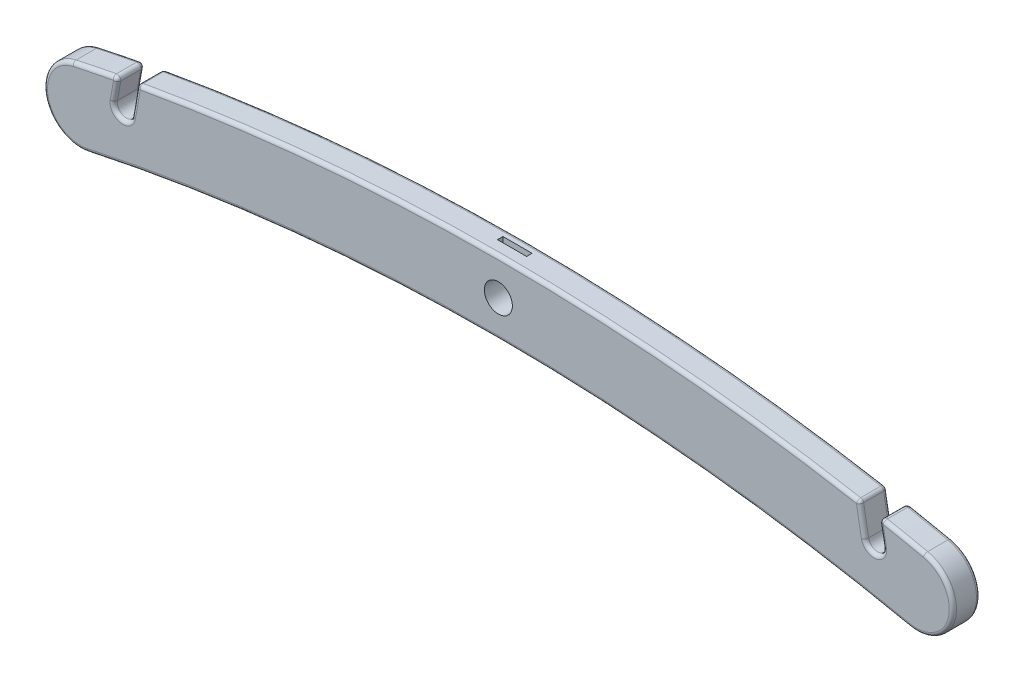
ISO-10303-21;
HEADER;
FILE_DESCRIPTION(('STEP AP214'),'2;1');
FILE_NAME('part.step','',(''),(''),'','','');
FILE_SCHEMA(('AUTOMOTIVE_DESIGN { 1 0 10303 214 1 1 1 1 }'));
ENDSEC;
DATA;
#1=APPLICATION_CONTEXT('core data for automotive mechanical design processes');
#2=APPLICATION_PROTOCOL_DEFINITION('international standard','automotive_design',2000,#1);
#3=PRODUCT_CONTEXT('',#1,'mechanical');
#4=PRODUCT('Part','Part','',(#3));
#5=PRODUCT_RELATED_PRODUCT_CATEGORY('part','',(#4));
#6=PRODUCT_DEFINITION_FORMATION('','',#4);
#7=PRODUCT_DEFINITION_CONTEXT('part definition',#1,'design');
#8=PRODUCT_DEFINITION('design','',#6,#7);
#9=PRODUCT_DEFINITION_SHAPE('','',#8);
#10=(LENGTH_UNIT() NAMED_UNIT(*) SI_UNIT(.MILLI.,.METRE.));
#11=(NAMED_UNIT(*) PLANE_ANGLE_UNIT() SI_UNIT($,.RADIAN.));
#12=(NAMED_UNIT(*) SI_UNIT($,.STERADIAN.) SOLID_ANGLE_UNIT());
#13=UNCERTAINTY_MEASURE_WITH_UNIT(LENGTH_MEASURE(1.E-05),#10,'distance_accuracy_value','');
#14=(GEOMETRIC_REPRESENTATION_CONTEXT(3) GLOBAL_UNCERTAINTY_ASSIGNED_CONTEXT((#13)) GLOBAL_UNIT_ASSIGNED_CONTEXT((#10,
#11,#12)) REPRESENTATION_CONTEXT('',''));
#15=CARTESIAN_POINT('',(0.,0.,0.));
#16=DIRECTION('',(0.,0.,1.));
#17=DIRECTION('',(1.,0.,0.));
#18=AXIS2_PLACEMENT_3D('',#15,#16,#17);
#19=CARTESIAN_POINT('',(0.,-775.,27.));
#20=DIRECTION('',(0.,0.,-1.));
#21=DIRECTION('',(-1.,0.,0.));
#22=AXIS2_PLACEMENT_3D('',#19,#20,#21);
#23=CYLINDRICAL_SURFACE('',#22,1120.);
#24=DIRECTION('',(0.,0.,-1.));
#25=VECTOR('',#24,1.);
#26=CARTESIAN_POINT('',(197.303818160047,327.484105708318,27.));
#27=LINE('',#26,#25);
#28=CARTESIAN_POINT('',(197.303818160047,327.484105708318,25.));
#29=VERTEX_POINT('',#28);
#30=CARTESIAN_POINT('',(197.303818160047,327.484105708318,14.));
#31=VERTEX_POINT('',#30);
#32=EDGE_CURVE('E307',#29,#31,#27,.T.);
#33=ORIENTED_EDGE('',*,*,#32,.T.);
#34=CARTESIAN_POINT('',(0.,-775.,14.));
#35=DIRECTION('',(0.,0.,1.));
#36=DIRECTION('',(1.,0.,0.));
#37=AXIS2_PLACEMENT_3D('',#34,#35,#36);
#38=CIRCLE('',#37,1120.);
#39=CARTESIAN_POINT('',(-197.303818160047,327.484105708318,14.));
#40=VERTEX_POINT('',#39);
#41=EDGE_CURVE('E12',#31,#40,#38,.T.);
#42=ORIENTED_EDGE('',*,*,#41,.T.);
#43=DIRECTION('',(0.,0.,-1.));
#44=VECTOR('',#43,1.);
#45=CARTESIAN_POINT('',(-197.303818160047,327.484105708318,27.));
#46=LINE('',#45,#44);
#47=CARTESIAN_POINT('',(-197.303818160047,327.484105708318,25.));
#48=VERTEX_POINT('',#47);
#49=EDGE_CURVE('E304',#48,#40,#46,.T.);
#50=ORIENTED_EDGE('',*,*,#49,.F.);
#51=CARTESIAN_POINT('',(0.,-775.,25.));
#52=DIRECTION('',(0.,0.,1.));
#53=DIRECTION('',(1.,0.,0.));
#54=AXIS2_PLACEMENT_3D('',#51,#52,#53);
#55=CIRCLE('',#54,1120.);
#56=EDGE_CURVE('E48',#48,#29,#55,.F.);
#57=ORIENTED_EDGE('',*,*,#56,.T.);
#58=EDGE_LOOP('',(#33,#42,#50,#57));
#59=FACE_BOUND('',#58,.T.);
#60=CARTESIAN_POINT('',(0.,-775.,19.5));
#61=DIRECTION('',(0.,0.,-1.));
#62=DIRECTION('',(-1.,0.,0.));
#63=AXIS2_PLACEMENT_3D('',#60,#61,#62);
#64=CIRCLE('',#63,1120.);
#65=CARTESIAN_POINT('',(-8.,344.971428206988,19.5));
#66=VERTEX_POINT('',#65);
#67=CARTESIAN_POINT('',(8.,344.971428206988,19.5));
#68=VERTEX_POINT('',#67);
#69=EDGE_CURVE('E335',#66,#68,#64,.T.);
#70=ORIENTED_EDGE('',*,*,#69,.F.);
#71=DIRECTION('',(0.,0.,-1.));
#72=VECTOR('',#71,1.);
#73=CARTESIAN_POINT('',(-8.,344.971428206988,27.));
#74=LINE('',#73,#72);
#75=CARTESIAN_POINT('',(-8.,344.971428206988,16.5));
#76=VERTEX_POINT('',#75);
#77=EDGE_CURVE('E256',#76,#66,#74,.F.);
#78=ORIENTED_EDGE('',*,*,#77,.F.);
#79=CARTESIAN_POINT('',(0.,-775.,16.5));
#80=DIRECTION('',(0.,0.,-1.));
#81=DIRECTION('',(-1.,0.,0.));
#82=AXIS2_PLACEMENT_3D('',#79,#80,#81);
#83=CIRCLE('',#82,1120.);
#84=CARTESIAN_POINT('',(8.,344.971428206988,16.5));
#85=VERTEX_POINT('',#84);
#86=EDGE_CURVE('E328',#76,#85,#83,.T.);
#87=ORIENTED_EDGE('',*,*,#86,.T.);
#88=DIRECTION('',(0.,0.,-1.));
#89=VECTOR('',#88,1.);
#90=CARTESIAN_POINT('',(8.,344.971428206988,27.));
#91=LINE('',#90,#89);
#92=EDGE_CURVE('E331',#68,#85,#91,.T.);
#93=ORIENTED_EDGE('',*,*,#92,.F.);
#94=EDGE_LOOP('',(#70,#78,#87,#93));
#95=FACE_BOUND('',#94,.T.);
#96=ADVANCED_FACE('F39',(#59,#95),#23,.T.);
#97=CARTESIAN_POINT('',(230.,300.68582773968,27.));
#98=DIRECTION('',(0.,0.,1.));
#99=DIRECTION('',(1.,0.,0.));
#100=AXIS2_PLACEMENT_3D('',#97,#98,#99);
#101=PLANE('',#100);
#102=CARTESIAN_POINT('',(206.59355070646,311.364414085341,27.));
#103=DIRECTION('',(0.,0.,1.));
#104=DIRECTION('',(1.,0.,0.));
#105=AXIS2_PLACEMENT_3D('',#102,#103,#104);
#106=CIRCLE('',#105,6.99999999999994);
#107=CARTESIAN_POINT('',(213.484204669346,312.596845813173,27.));
#108=VERTEX_POINT('',#107);
#109=CARTESIAN_POINT('',(199.702896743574,310.131982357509,27.));
#110=VERTEX_POINT('',#109);
#111=EDGE_CURVE('E56',#108,#110,#106,.F.);
#112=ORIENTED_EDGE('',*,*,#111,.T.);
#113=DIRECTION('',(-0.176061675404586,0.984379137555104,0.));
#114=VECTOR('',#113,1.);
#115=CARTESIAN_POINT('',(196.951489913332,325.515384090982,27.));
#116=LINE('',#115,#114);
#117=CARTESIAN_POINT('',(196.951489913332,325.515384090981,27.));
#118=VERTEX_POINT('',#117);
#119=EDGE_CURVE('E444',#110,#118,#116,.T.);
#120=ORIENTED_EDGE('',*,*,#119,.T.);
#121=CARTESIAN_POINT('',(0.,-775.,27.));
#122=DIRECTION('',(0.,0.,1.));
#123=DIRECTION('',(1.,0.,0.));
#124=AXIS2_PLACEMENT_3D('',#121,#122,#123);
#125=CIRCLE('',#124,1118.);
#126=CARTESIAN_POINT('',(-196.951489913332,325.515384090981,27.));
#127=VERTEX_POINT('',#126);
#128=EDGE_CURVE('E424',#118,#127,#125,.T.);
#129=ORIENTED_EDGE('',*,*,#128,.T.);
#130=DIRECTION('',(-0.176061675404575,-0.984379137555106,0.));
#131=VECTOR('',#130,1.);
#132=CARTESIAN_POINT('',(-199.702896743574,310.131982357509,27.));
#133=LINE('',#132,#131);
#134=CARTESIAN_POINT('',(-199.702896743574,310.131982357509,27.));
#135=VERTEX_POINT('',#134);
#136=EDGE_CURVE('E426',#127,#135,#133,.T.);
#137=ORIENTED_EDGE('',*,*,#136,.T.);
#138=CARTESIAN_POINT('',(-206.59355070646,311.364414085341,27.));
#139=DIRECTION('',(0.,0.,1.));
#140=DIRECTION('',(1.,0.,0.));
#141=AXIS2_PLACEMENT_3D('',#138,#139,#140);
#142=CIRCLE('',#141,6.99999999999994);
#143=CARTESIAN_POINT('',(-213.484204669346,312.596845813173,27.));
#144=VERTEX_POINT('',#143);
#145=EDGE_CURVE('E428',#135,#144,#142,.F.);
#146=ORIENTED_EDGE('',*,*,#145,.T.);
#147=DIRECTION('',(0.176061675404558,0.984379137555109,0.));
#148=VECTOR('',#147,1.);
#149=CARTESIAN_POINT('',(-211.662731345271,322.780892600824,27.));
#150=LINE('',#149,#148);
#151=CARTESIAN_POINT('',(-211.662731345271,322.780892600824,27.));
#152=VERTEX_POINT('',#151);
#153=EDGE_CURVE('E430',#144,#152,#150,.T.);
#154=ORIENTED_EDGE('',*,*,#153,.T.);
#155=CARTESIAN_POINT('',(0.,-775.,27.));
#156=DIRECTION('',(0.,0.,1.));
#157=DIRECTION('',(1.,0.,0.));
#158=AXIS2_PLACEMENT_3D('',#155,#156,#157);
#159=CIRCLE('',#158,1118.);
#160=CARTESIAN_POINT('',(-233.763646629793,318.28795727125,27.));
#161=VERTEX_POINT('',#160);
#162=EDGE_CURVE('E432',#152,#161,#159,.T.);
#163=ORIENTED_EDGE('',*,*,#162,.T.);
#164=CARTESIAN_POINT('',(-230.,300.68582773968,27.));
#165=DIRECTION('',(0.,0.,1.));
#166=DIRECTION('',(1.,0.,0.));
#167=AXIS2_PLACEMENT_3D('',#164,#165,#166);
#168=CIRCLE('',#167,18.000000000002);
#169=CARTESIAN_POINT('',(-226.236363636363,283.083696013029,27.));
#170=VERTEX_POINT('',#169);
#171=EDGE_CURVE('E434',#161,#170,#168,.T.);
#172=ORIENTED_EDGE('',*,*,#171,.T.);
#173=CARTESIAN_POINT('',(0.,-775.,27.));
#174=DIRECTION('',(0.,0.,1.));
#175=DIRECTION('',(1.,0.,0.));
#176=AXIS2_PLACEMENT_3D('',#173,#174,#175);
#177=CIRCLE('',#176,1082.);
#178=CARTESIAN_POINT('',(226.236363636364,283.08369601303,27.));
#179=VERTEX_POINT('',#178);
#180=EDGE_CURVE('E436',#170,#179,#177,.F.);
#181=ORIENTED_EDGE('',*,*,#180,.T.);
#182=CARTESIAN_POINT('',(230.,300.68582773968,27.));
#183=DIRECTION('',(0.,0.,1.));
#184=DIRECTION('',(1.,0.,0.));
#185=AXIS2_PLACEMENT_3D('',#182,#183,#184);
#186=CIRCLE('',#185,18.0000000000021);
#187=CARTESIAN_POINT('',(233.763647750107,318.287957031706,27.));
#188=VERTEX_POINT('',#187);
#189=EDGE_CURVE('E438',#179,#188,#186,.T.);
#190=ORIENTED_EDGE('',*,*,#189,.T.);
#191=CARTESIAN_POINT('',(0.,-775.,27.));
#192=DIRECTION('',(0.,0.,1.));
#193=DIRECTION('',(1.,0.,0.));
#194=AXIS2_PLACEMENT_3D('',#191,#192,#193);
#195=CIRCLE('',#194,1118.);
#196=CARTESIAN_POINT('',(211.662731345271,322.780892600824,27.));
#197=VERTEX_POINT('',#196);
#198=EDGE_CURVE('E440',#188,#197,#195,.T.);
#199=ORIENTED_EDGE('',*,*,#198,.T.);
#200=DIRECTION('',(0.176061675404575,-0.984379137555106,0.));
#201=VECTOR('',#200,1.);
#202=CARTESIAN_POINT('',(213.484204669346,312.596845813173,27.));
#203=LINE('',#202,#201);
#204=EDGE_CURVE('E61',#197,#108,#203,.T.);
#205=ORIENTED_EDGE('',*,*,#204,.T.);
#206=EDGE_LOOP('',(#112,#120,#129,#137,#146,#154,#163,#172,#181,#190,#199,#205));
#207=FACE_BOUND('',#206,.T.);
#208=CARTESIAN_POINT('',(0.,325.,27.));
#209=DIRECTION('',(0.,0.,1.));
#210=DIRECTION('',(1.,0.,0.));
#211=AXIS2_PLACEMENT_3D('',#208,#209,#210);
#212=CIRCLE('',#211,7.70000000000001);
#213=CARTESIAN_POINT('',(7.70000000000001,325.,27.));
#214=VERTEX_POINT('',#213);
#215=EDGE_CURVE('E276',#214,#214,#212,.T.);
#216=ORIENTED_EDGE('',*,*,#215,.F.);
#217=EDGE_LOOP('',(#216));
#218=FACE_BOUND('',#217,.T.);
#219=ADVANCED_FACE('F544',(#207,#218),#101,.T.);
#220=CARTESIAN_POINT('',(230.,300.68582773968,12.));
#221=DIRECTION('',(0.,0.,1.));
#222=DIRECTION('',(1.,0.,0.));
#223=AXIS2_PLACEMENT_3D('',#220,#221,#222);
#224=PLANE('',#223);
#225=CARTESIAN_POINT('',(0.,-775.,12.));
#226=DIRECTION('',(0.,0.,1.));
#227=DIRECTION('',(1.,0.,0.));
#228=AXIS2_PLACEMENT_3D('',#225,#226,#227);
#229=CIRCLE('',#228,1118.);
#230=CARTESIAN_POINT('',(-196.951489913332,325.515384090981,12.));
#231=VERTEX_POINT('',#230);
#232=CARTESIAN_POINT('',(196.951489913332,325.515384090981,12.));
#233=VERTEX_POINT('',#232);
#234=EDGE_CURVE('E347',#231,#233,#229,.F.);
#235=ORIENTED_EDGE('',*,*,#234,.T.);
#236=DIRECTION('',(-0.176061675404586,0.984379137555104,0.));
#237=VECTOR('',#236,1.);
#238=CARTESIAN_POINT('',(202.279164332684,295.727802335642,12.));
#239=LINE('',#238,#237);
#240=CARTESIAN_POINT('',(199.702896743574,310.131982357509,12.));
#241=VERTEX_POINT('',#240);
#242=EDGE_CURVE('E369',#233,#241,#239,.F.);
#243=ORIENTED_EDGE('',*,*,#242,.T.);
#244=CARTESIAN_POINT('',(206.59355070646,311.364414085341,12.));
#245=DIRECTION('',(0.,0.,1.));
#246=DIRECTION('',(1.,0.,0.));
#247=AXIS2_PLACEMENT_3D('',#244,#245,#246);
#248=CIRCLE('',#247,6.99999999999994);
#249=CARTESIAN_POINT('',(213.484204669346,312.596845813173,12.));
#250=VERTEX_POINT('',#249);
#251=EDGE_CURVE('E367',#241,#250,#248,.T.);
#252=ORIENTED_EDGE('',*,*,#251,.T.);
#253=DIRECTION('',(0.176061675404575,-0.984379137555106,0.));
#254=VECTOR('',#253,1.);
#255=CARTESIAN_POINT('',(216.060472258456,298.192665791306,12.));
#256=LINE('',#255,#254);
#257=CARTESIAN_POINT('',(211.662731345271,322.780892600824,12.));
#258=VERTEX_POINT('',#257);
#259=EDGE_CURVE('E365',#250,#258,#256,.F.);
#260=ORIENTED_EDGE('',*,*,#259,.T.);
#261=CARTESIAN_POINT('',(0.,-775.,12.));
#262=DIRECTION('',(0.,0.,1.));
#263=DIRECTION('',(1.,0.,0.));
#264=AXIS2_PLACEMENT_3D('',#261,#262,#263);
#265=CIRCLE('',#264,1118.);
#266=CARTESIAN_POINT('',(233.763647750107,318.287957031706,12.));
#267=VERTEX_POINT('',#266);
#268=EDGE_CURVE('E363',#258,#267,#265,.F.);
#269=ORIENTED_EDGE('',*,*,#268,.T.);
#270=CARTESIAN_POINT('',(230.,300.68582773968,12.));
#271=DIRECTION('',(0.,0.,1.));
#272=DIRECTION('',(1.,0.,0.));
#273=AXIS2_PLACEMENT_3D('',#270,#271,#272);
#274=CIRCLE('',#273,18.0000000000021);
#275=CARTESIAN_POINT('',(226.236363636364,283.08369601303,12.));
#276=VERTEX_POINT('',#275);
#277=EDGE_CURVE('E361',#267,#276,#274,.F.);
#278=ORIENTED_EDGE('',*,*,#277,.T.);
#279=CARTESIAN_POINT('',(0.,-775.,12.));
#280=DIRECTION('',(0.,0.,1.));
#281=DIRECTION('',(1.,0.,0.));
#282=AXIS2_PLACEMENT_3D('',#279,#280,#281);
#283=CIRCLE('',#282,1082.);
#284=CARTESIAN_POINT('',(-226.236363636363,283.083696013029,12.));
#285=VERTEX_POINT('',#284);
#286=EDGE_CURVE('E359',#276,#285,#283,.T.);
#287=ORIENTED_EDGE('',*,*,#286,.T.);
#288=CARTESIAN_POINT('',(-230.,300.68582773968,12.));
#289=DIRECTION('',(0.,0.,1.));
#290=DIRECTION('',(1.,0.,0.));
#291=AXIS2_PLACEMENT_3D('',#288,#289,#290);
#292=CIRCLE('',#291,18.000000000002);
#293=CARTESIAN_POINT('',(-233.763646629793,318.28795727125,12.));
#294=VERTEX_POINT('',#293);
#295=EDGE_CURVE('E357',#285,#294,#292,.F.);
#296=ORIENTED_EDGE('',*,*,#295,.T.);
#297=CARTESIAN_POINT('',(0.,-775.,12.));
#298=DIRECTION('',(0.,0.,1.));
#299=DIRECTION('',(1.,0.,0.));
#300=AXIS2_PLACEMENT_3D('',#297,#298,#299);
#301=CIRCLE('',#300,1118.);
#302=CARTESIAN_POINT('',(-211.662731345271,322.780892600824,12.));
#303=VERTEX_POINT('',#302);
#304=EDGE_CURVE('E355',#294,#303,#301,.F.);
#305=ORIENTED_EDGE('',*,*,#304,.T.);
#306=DIRECTION('',(0.176061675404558,0.984379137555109,0.));
#307=VECTOR('',#306,1.);
#308=CARTESIAN_POINT('',(-201.801524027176,377.91592827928,12.));
#309=LINE('',#308,#307);
#310=CARTESIAN_POINT('',(-213.484204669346,312.596845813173,12.));
#311=VERTEX_POINT('',#310);
#312=EDGE_CURVE('E353',#303,#311,#309,.F.);
#313=ORIENTED_EDGE('',*,*,#312,.T.);
#314=CARTESIAN_POINT('',(-206.59355070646,311.364414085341,12.));
#315=DIRECTION('',(0.,0.,1.));
#316=DIRECTION('',(1.,0.,0.));
#317=AXIS2_PLACEMENT_3D('',#314,#315,#316);
#318=CIRCLE('',#317,6.99999999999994);
#319=CARTESIAN_POINT('',(-199.702896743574,310.131982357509,12.));
#320=VERTEX_POINT('',#319);
#321=EDGE_CURVE('E351',#311,#320,#318,.T.);
#322=ORIENTED_EDGE('',*,*,#321,.T.);
#323=DIRECTION('',(-0.176061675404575,-0.984379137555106,0.));
#324=VECTOR('',#323,1.);
#325=CARTESIAN_POINT('',(-188.020216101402,375.451064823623,12.));
#326=LINE('',#325,#324);
#327=EDGE_CURVE('E349',#320,#231,#326,.F.);
#328=ORIENTED_EDGE('',*,*,#327,.T.);
#329=EDGE_LOOP('',(#235,#243,#252,#260,#269,#278,#287,#296,#305,#313,#322,#328));
#330=FACE_BOUND('',#329,.T.);
#331=CARTESIAN_POINT('',(0.,325.,12.));
#332=DIRECTION('',(0.,0.,1.));
#333=DIRECTION('',(1.,0.,0.));
#334=AXIS2_PLACEMENT_3D('',#331,#332,#333);
#335=CIRCLE('',#334,7.70000000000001);
#336=CARTESIAN_POINT('',(7.70000000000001,325.,12.));
#337=VERTEX_POINT('',#336);
#338=EDGE_CURVE('E43',#337,#337,#335,.T.);
#339=ORIENTED_EDGE('',*,*,#338,.T.);
#340=EDGE_LOOP('',(#339));
#341=FACE_BOUND('',#340,.T.);
#342=ADVANCED_FACE('F546',(#330,#341),#224,.F.);
#343=CARTESIAN_POINT('',(230.,300.68582773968,27.));
#344=DIRECTION('',(0.,0.,-1.));
#345=DIRECTION('',(-1.,0.,0.));
#346=AXIS2_PLACEMENT_3D('',#343,#344,#345);
#347=CYLINDRICAL_SURFACE('',#346,20.0000000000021);
#348=DIRECTION('',(0.,0.,-1.));
#349=VECTOR('',#348,1.);
#350=CARTESIAN_POINT('',(225.818181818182,281.127903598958,27.));
#351=LINE('',#350,#349);
#352=CARTESIAN_POINT('',(225.818181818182,281.127903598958,25.));
#353=VERTEX_POINT('',#352);
#354=CARTESIAN_POINT('',(225.818181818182,281.127903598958,14.));
#355=VERTEX_POINT('',#354);
#356=EDGE_CURVE('E280',#353,#355,#351,.T.);
#357=ORIENTED_EDGE('',*,*,#356,.T.);
#358=CARTESIAN_POINT('',(230.,300.68582773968,14.));
#359=DIRECTION('',(0.,0.,1.));
#360=DIRECTION('',(1.,0.,0.));
#361=AXIS2_PLACEMENT_3D('',#358,#359,#360);
#362=CIRCLE('',#361,20.0000000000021);
#363=CARTESIAN_POINT('',(234.181829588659,320.243749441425,14.));
#364=VERTEX_POINT('',#363);
#365=EDGE_CURVE('E390',#355,#364,#362,.T.);
#366=ORIENTED_EDGE('',*,*,#365,.T.);
#367=DIRECTION('',(0.,0.,-1.));
#368=VECTOR('',#367,1.);
#369=CARTESIAN_POINT('',(234.181829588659,320.243749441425,27.));
#370=LINE('',#369,#368);
#371=CARTESIAN_POINT('',(234.181829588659,320.243749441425,25.));
#372=VERTEX_POINT('',#371);
#373=EDGE_CURVE('E325',#372,#364,#370,.T.);
#374=ORIENTED_EDGE('',*,*,#373,.F.);
#375=CARTESIAN_POINT('',(230.,300.68582773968,25.));
#376=DIRECTION('',(0.,0.,1.));
#377=DIRECTION('',(1.,0.,0.));
#378=AXIS2_PLACEMENT_3D('',#375,#376,#377);
#379=CIRCLE('',#378,20.0000000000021);
#380=EDGE_CURVE('E388',#372,#353,#379,.F.);
#381=ORIENTED_EDGE('',*,*,#380,.T.);
#382=EDGE_LOOP('',(#357,#366,#374,#381));
#383=FACE_BOUND('',#382,.T.);
#384=ADVANCED_FACE('F552',(#383),#347,.T.);
#385=CARTESIAN_POINT('',(0.,-775.,27.));
#386=DIRECTION('',(0.,0.,-1.));
#387=DIRECTION('',(-1.,0.,0.));
#388=AXIS2_PLACEMENT_3D('',#385,#386,#387);
#389=CYLINDRICAL_SURFACE('',#388,1120.);
#390=ORIENTED_EDGE('',*,*,#373,.T.);
#391=CARTESIAN_POINT('',(0.,-775.,14.));
#392=DIRECTION('',(0.,0.,1.));
#393=DIRECTION('',(1.,0.,0.));
#394=AXIS2_PLACEMENT_3D('',#391,#392,#393);
#395=CIRCLE('',#394,1120.);
#396=CARTESIAN_POINT('',(212.041376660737,324.744722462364,14.));
#397=VERTEX_POINT('',#396);
#398=EDGE_CURVE('E386',#364,#397,#395,.T.);
#399=ORIENTED_EDGE('',*,*,#398,.T.);
#400=DIRECTION('',(0.,0.,-1.));
#401=VECTOR('',#400,1.);
#402=CARTESIAN_POINT('',(212.041376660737,324.744722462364,27.));
#403=LINE('',#402,#401);
#404=CARTESIAN_POINT('',(212.041376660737,324.744722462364,25.));
#405=VERTEX_POINT('',#404);
#406=EDGE_CURVE('E322',#405,#397,#403,.T.);
#407=ORIENTED_EDGE('',*,*,#406,.F.);
#408=CARTESIAN_POINT('',(0.,-775.,25.));
#409=DIRECTION('',(0.,0.,1.));
#410=DIRECTION('',(1.,0.,0.));
#411=AXIS2_PLACEMENT_3D('',#408,#409,#410);
#412=CIRCLE('',#411,1120.);
#413=EDGE_CURVE('E384',#405,#372,#412,.F.);
#414=ORIENTED_EDGE('',*,*,#413,.T.);
#415=EDGE_LOOP('',(#390,#399,#407,#414));
#416=FACE_BOUND('',#415,.T.);
#417=ADVANCED_FACE('F612',(#416),#389,.T.);
#418=CARTESIAN_POINT('',(211.662731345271,322.780892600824,27.));
#419=DIRECTION('',(0.,0.,-1.));
#420=DIRECTION('',(-1.,0.,0.));
#421=AXIS2_PLACEMENT_3D('',#418,#419,#420);
#422=CYLINDRICAL_SURFACE('',#421,2.00000000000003);
#423=ORIENTED_EDGE('',*,*,#406,.T.);
#424=CARTESIAN_POINT('',(211.662731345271,322.780892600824,14.));
#425=DIRECTION('',(0.,0.,-1.));
#426=DIRECTION('',(-1.,0.,0.));
#427=AXIS2_PLACEMENT_3D('',#424,#425,#426);
#428=CIRCLE('',#427,2.00000000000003);
#429=CARTESIAN_POINT('',(209.693973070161,322.428769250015,14.));
#430=VERTEX_POINT('',#429);
#431=EDGE_CURVE('E382',#397,#430,#428,.F.);
#432=ORIENTED_EDGE('',*,*,#431,.T.);
#433=DIRECTION('',(0.,0.,-1.));
#434=VECTOR('',#433,1.);
#435=CARTESIAN_POINT('',(209.693973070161,322.428769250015,27.));
#436=LINE('',#435,#434);
#437=CARTESIAN_POINT('',(209.693973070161,322.428769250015,25.));
#438=VERTEX_POINT('',#437);
#439=EDGE_CURVE('E319',#438,#430,#436,.T.);
#440=ORIENTED_EDGE('',*,*,#439,.F.);
#441=CARTESIAN_POINT('',(211.662731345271,322.780892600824,25.));
#442=DIRECTION('',(0.,0.,-1.));
#443=DIRECTION('',(-1.,0.,0.));
#444=AXIS2_PLACEMENT_3D('',#441,#442,#443);
#445=CIRCLE('',#444,2.00000000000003);
#446=EDGE_CURVE('E380',#438,#405,#445,.T.);
#447=ORIENTED_EDGE('',*,*,#446,.T.);
#448=EDGE_LOOP('',(#423,#432,#440,#447));
#449=FACE_BOUND('',#448,.T.);
#450=ADVANCED_FACE('F608',(#449),#422,.T.);
#451=CARTESIAN_POINT('',(209.693973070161,322.428769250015,27.));
#452=DIRECTION('',(0.984379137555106,0.176061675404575,0.));
#453=DIRECTION('',(-0.176061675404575,0.984379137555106,0.));
#454=AXIS2_PLACEMENT_3D('',#451,#452,#453);
#455=PLANE('',#454);
#456=ORIENTED_EDGE('',*,*,#439,.T.);
#457=DIRECTION('',(0.176061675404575,-0.984379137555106,0.));
#458=VECTOR('',#457,1.);
#459=CARTESIAN_POINT('',(209.693973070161,322.428769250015,14.));
#460=LINE('',#459,#458);
#461=CARTESIAN_POINT('',(211.515446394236,312.244722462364,14.));
#462=VERTEX_POINT('',#461);
#463=EDGE_CURVE('E378',#430,#462,#460,.T.);
#464=ORIENTED_EDGE('',*,*,#463,.T.);
#465=DIRECTION('',(0.,0.,-1.));
#466=VECTOR('',#465,1.);
#467=CARTESIAN_POINT('',(211.515446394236,312.244722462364,27.));
#468=LINE('',#467,#466);
#469=CARTESIAN_POINT('',(211.515446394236,312.244722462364,25.));
#470=VERTEX_POINT('',#469);
#471=EDGE_CURVE('E316',#470,#462,#468,.T.);
#472=ORIENTED_EDGE('',*,*,#471,.F.);
#473=DIRECTION('',(0.176061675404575,-0.984379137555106,0.));
#474=VECTOR('',#473,1.);
#475=CARTESIAN_POINT('',(209.693973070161,322.428769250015,25.));
#476=LINE('',#475,#474);
#477=EDGE_CURVE('E376',#470,#438,#476,.F.);
#478=ORIENTED_EDGE('',*,*,#477,.T.);
#479=EDGE_LOOP('',(#456,#464,#472,#478));
#480=FACE_BOUND('',#479,.T.);
#481=ADVANCED_FACE('F604',(#480),#455,.F.);
#482=CARTESIAN_POINT('',(206.59355070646,311.364414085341,27.));
#483=DIRECTION('',(0.,0.,-1.));
#484=DIRECTION('',(-1.,0.,0.));
#485=AXIS2_PLACEMENT_3D('',#482,#483,#484);
#486=CYLINDRICAL_SURFACE('',#485,4.99999999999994);
#487=ORIENTED_EDGE('',*,*,#471,.T.);
#488=CARTESIAN_POINT('',(206.59355070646,311.364414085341,14.));
#489=DIRECTION('',(0.,0.,1.));
#490=DIRECTION('',(1.,0.,0.));
#491=AXIS2_PLACEMENT_3D('',#488,#489,#490);
#492=CIRCLE('',#491,4.99999999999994);
#493=CARTESIAN_POINT('',(201.671655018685,310.484105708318,14.));
#494=VERTEX_POINT('',#493);
#495=EDGE_CURVE('E374',#462,#494,#492,.F.);
#496=ORIENTED_EDGE('',*,*,#495,.T.);
#497=DIRECTION('',(0.,0.,-1.));
#498=VECTOR('',#497,1.);
#499=CARTESIAN_POINT('',(201.671655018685,310.484105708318,27.));
#500=LINE('',#499,#498);
#501=CARTESIAN_POINT('',(201.671655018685,310.484105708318,25.));
#502=VERTEX_POINT('',#501);
#503=EDGE_CURVE('E313',#502,#494,#500,.T.);
#504=ORIENTED_EDGE('',*,*,#503,.F.);
#505=CARTESIAN_POINT('',(206.59355070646,311.364414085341,25.));
#506=DIRECTION('',(0.,0.,1.));
#507=DIRECTION('',(1.,0.,0.));
#508=AXIS2_PLACEMENT_3D('',#505,#506,#507);
#509=CIRCLE('',#508,4.99999999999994);
#510=EDGE_CURVE('E372',#502,#470,#509,.T.);
#511=ORIENTED_EDGE('',*,*,#510,.T.);
#512=EDGE_LOOP('',(#487,#496,#504,#511));
#513=FACE_BOUND('',#512,.T.);
#514=ADVANCED_FACE('F600',(#513),#486,.F.);
#515=CARTESIAN_POINT('',(198.920248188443,325.867507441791,27.));
#516=DIRECTION('',(-0.984379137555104,-0.176061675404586,0.));
#517=DIRECTION('',(0.176061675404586,-0.984379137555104,0.));
#518=AXIS2_PLACEMENT_3D('',#515,#516,#517);
#519=PLANE('',#518);
#520=ORIENTED_EDGE('',*,*,#503,.T.);
#521=DIRECTION('',(-0.176061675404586,0.984379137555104,0.));
#522=VECTOR('',#521,1.);
#523=CARTESIAN_POINT('',(198.920248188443,325.867507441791,14.));
#524=LINE('',#523,#522);
#525=CARTESIAN_POINT('',(198.920248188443,325.867507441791,14.));
#526=VERTEX_POINT('',#525);
#527=EDGE_CURVE('E345',#494,#526,#524,.T.);
#528=ORIENTED_EDGE('',*,*,#527,.T.);
#529=DIRECTION('',(0.,0.,-1.));
#530=VECTOR('',#529,1.);
#531=CARTESIAN_POINT('',(198.920248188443,325.867507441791,27.));
#532=LINE('',#531,#530);
#533=CARTESIAN_POINT('',(198.920248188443,325.867507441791,25.));
#534=VERTEX_POINT('',#533);
#535=EDGE_CURVE('E310',#534,#526,#532,.T.);
#536=ORIENTED_EDGE('',*,*,#535,.F.);
#537=DIRECTION('',(-0.176061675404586,0.984379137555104,0.));
#538=VECTOR('',#537,1.);
#539=CARTESIAN_POINT('',(201.671655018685,310.484105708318,25.));
#540=LINE('',#539,#538);
#541=EDGE_CURVE('E343',#534,#502,#540,.F.);
#542=ORIENTED_EDGE('',*,*,#541,.T.);
#543=EDGE_LOOP('',(#520,#528,#536,#542));
#544=FACE_BOUND('',#543,.T.);
#545=ADVANCED_FACE('F596',(#544),#519,.F.);
#546=CARTESIAN_POINT('',(196.951489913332,325.515384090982,27.));
#547=DIRECTION('',(0.,0.,-1.));
#548=DIRECTION('',(-1.,0.,0.));
#549=AXIS2_PLACEMENT_3D('',#546,#547,#548);
#550=CYLINDRICAL_SURFACE('',#549,1.99999999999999);
#551=ORIENTED_EDGE('',*,*,#535,.T.);
#552=CARTESIAN_POINT('',(196.951489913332,325.515384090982,14.));
#553=DIRECTION('',(0.,0.,-1.));
#554=DIRECTION('',(-1.,0.,0.));
#555=AXIS2_PLACEMENT_3D('',#552,#553,#554);
#556=CIRCLE('',#555,1.99999999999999);
#557=EDGE_CURVE('E340',#526,#31,#556,.F.);
#558=ORIENTED_EDGE('',*,*,#557,.T.);
#559=ORIENTED_EDGE('',*,*,#32,.F.);
#560=CARTESIAN_POINT('',(196.951489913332,325.515384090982,25.));
#561=DIRECTION('',(0.,0.,-1.));
#562=DIRECTION('',(-1.,0.,0.));
#563=AXIS2_PLACEMENT_3D('',#560,#561,#562);
#564=CIRCLE('',#563,1.99999999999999);
#565=EDGE_CURVE('E337',#29,#534,#564,.T.);
#566=ORIENTED_EDGE('',*,*,#565,.T.);
#567=EDGE_LOOP('',(#551,#558,#559,#566));
#568=FACE_BOUND('',#567,.T.);
#569=ADVANCED_FACE('F591',(#568),#550,.T.);
#570=CARTESIAN_POINT('',(-196.951489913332,325.515384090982,27.));
#571=DIRECTION('',(0.,0.,-1.));
#572=DIRECTION('',(-1.,0.,0.));
#573=AXIS2_PLACEMENT_3D('',#570,#571,#572);
#574=CYLINDRICAL_SURFACE('',#573,1.99999999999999);
#575=ORIENTED_EDGE('',*,*,#49,.T.);
#576=CARTESIAN_POINT('',(-196.951489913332,325.515384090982,14.));
#577=DIRECTION('',(0.,0.,-1.));
#578=DIRECTION('',(-1.,0.,0.));
#579=AXIS2_PLACEMENT_3D('',#576,#577,#578);
#580=CIRCLE('',#579,1.99999999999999);
#581=CARTESIAN_POINT('',(-198.920248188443,325.867507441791,14.));
#582=VERTEX_POINT('',#581);
#583=EDGE_CURVE('E422',#40,#582,#580,.F.);
#584=ORIENTED_EDGE('',*,*,#583,.T.);
#585=DIRECTION('',(0.,0.,-1.));
#586=VECTOR('',#585,1.);
#587=CARTESIAN_POINT('',(-198.920248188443,325.867507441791,27.));
#588=LINE('',#587,#586);
#589=CARTESIAN_POINT('',(-198.920248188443,325.867507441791,25.));
#590=VERTEX_POINT('',#589);
#591=EDGE_CURVE('E301',#590,#582,#588,.T.);
#592=ORIENTED_EDGE('',*,*,#591,.F.);
#593=CARTESIAN_POINT('',(-196.951489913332,325.515384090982,25.));
#594=DIRECTION('',(0.,0.,-1.));
#595=DIRECTION('',(-1.,0.,0.));
#596=AXIS2_PLACEMENT_3D('',#593,#594,#595);
#597=CIRCLE('',#596,1.99999999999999);
#598=EDGE_CURVE('E420',#590,#48,#597,.T.);
#599=ORIENTED_EDGE('',*,*,#598,.T.);
#600=EDGE_LOOP('',(#575,#584,#592,#599));
#601=FACE_BOUND('',#600,.T.);
#602=ADVANCED_FACE('F588',(#601),#574,.T.);
#603=CARTESIAN_POINT('',(-198.920248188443,325.867507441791,27.));
#604=DIRECTION('',(0.984379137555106,-0.176061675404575,0.));
#605=DIRECTION('',(0.176061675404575,0.984379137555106,0.));
#606=AXIS2_PLACEMENT_3D('',#603,#604,#605);
#607=PLANE('',#606);
#608=ORIENTED_EDGE('',*,*,#591,.T.);
#609=DIRECTION('',(-0.176061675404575,-0.984379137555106,0.));
#610=VECTOR('',#609,1.);
#611=CARTESIAN_POINT('',(-198.920248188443,325.867507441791,14.));
#612=LINE('',#611,#610);
#613=CARTESIAN_POINT('',(-201.671655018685,310.484105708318,14.));
#614=VERTEX_POINT('',#613);
#615=EDGE_CURVE('E418',#582,#614,#612,.T.);
#616=ORIENTED_EDGE('',*,*,#615,.T.);
#617=DIRECTION('',(0.,0.,-1.));
#618=VECTOR('',#617,1.);
#619=CARTESIAN_POINT('',(-201.671655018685,310.484105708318,27.));
#620=LINE('',#619,#618);
#621=CARTESIAN_POINT('',(-201.671655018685,310.484105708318,25.));
#622=VERTEX_POINT('',#621);
#623=EDGE_CURVE('E298',#622,#614,#620,.T.);
#624=ORIENTED_EDGE('',*,*,#623,.F.);
#625=DIRECTION('',(-0.176061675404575,-0.984379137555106,0.));
#626=VECTOR('',#625,1.);
#627=CARTESIAN_POINT('',(-198.920248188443,325.867507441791,25.));
#628=LINE('',#627,#626);
#629=EDGE_CURVE('E416',#622,#590,#628,.F.);
#630=ORIENTED_EDGE('',*,*,#629,.T.);
#631=EDGE_LOOP('',(#608,#616,#624,#630));
#632=FACE_BOUND('',#631,.T.);
#633=ADVANCED_FACE('F584',(#632),#607,.F.);
#634=CARTESIAN_POINT('',(-206.59355070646,311.364414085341,27.));
#635=DIRECTION('',(0.,0.,-1.));
#636=DIRECTION('',(-1.,0.,0.));
#637=AXIS2_PLACEMENT_3D('',#634,#635,#636);
#638=CYLINDRICAL_SURFACE('',#637,4.99999999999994);
#639=ORIENTED_EDGE('',*,*,#623,.T.);
#640=CARTESIAN_POINT('',(-206.59355070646,311.364414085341,14.));
#641=DIRECTION('',(0.,0.,1.));
#642=DIRECTION('',(1.,0.,0.));
#643=AXIS2_PLACEMENT_3D('',#640,#641,#642);
#644=CIRCLE('',#643,4.99999999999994);
#645=CARTESIAN_POINT('',(-211.515446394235,312.244722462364,14.));
#646=VERTEX_POINT('',#645);
#647=EDGE_CURVE('E414',#614,#646,#644,.F.);
#648=ORIENTED_EDGE('',*,*,#647,.T.);
#649=DIRECTION('',(0.,0.,-1.));
#650=VECTOR('',#649,1.);
#651=CARTESIAN_POINT('',(-211.515446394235,312.244722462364,27.));
#652=LINE('',#651,#650);
#653=CARTESIAN_POINT('',(-211.515446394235,312.244722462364,25.));
#654=VERTEX_POINT('',#653);
#655=EDGE_CURVE('E295',#654,#646,#652,.T.);
#656=ORIENTED_EDGE('',*,*,#655,.F.);
#657=CARTESIAN_POINT('',(-206.59355070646,311.364414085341,25.));
#658=DIRECTION('',(0.,0.,1.));
#659=DIRECTION('',(1.,0.,0.));
#660=AXIS2_PLACEMENT_3D('',#657,#658,#659);
#661=CIRCLE('',#660,4.99999999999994);
#662=EDGE_CURVE('E412',#654,#622,#661,.T.);
#663=ORIENTED_EDGE('',*,*,#662,.T.);
#664=EDGE_LOOP('',(#639,#648,#656,#663));
#665=FACE_BOUND('',#664,.T.);
#666=ADVANCED_FACE('F580',(#665),#638,.F.);
#667=CARTESIAN_POINT('',(-209.693973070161,322.428769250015,27.));
#668=DIRECTION('',(-0.984379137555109,0.176061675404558,0.));
#669=DIRECTION('',(-0.176061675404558,-0.984379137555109,0.));
#670=AXIS2_PLACEMENT_3D('',#667,#668,#669);
#671=PLANE('',#670);
#672=ORIENTED_EDGE('',*,*,#655,.T.);
#673=DIRECTION('',(0.176061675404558,0.984379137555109,0.));
#674=VECTOR('',#673,1.);
#675=CARTESIAN_POINT('',(-209.693973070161,322.428769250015,14.));
#676=LINE('',#675,#674);
#677=CARTESIAN_POINT('',(-209.693973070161,322.428769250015,14.));
#678=VERTEX_POINT('',#677);
#679=EDGE_CURVE('E410',#646,#678,#676,.T.);
#680=ORIENTED_EDGE('',*,*,#679,.T.);
#681=DIRECTION('',(0.,0.,-1.));
#682=VECTOR('',#681,1.);
#683=CARTESIAN_POINT('',(-209.693973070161,322.428769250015,27.));
#684=LINE('',#683,#682);
#685=CARTESIAN_POINT('',(-209.693973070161,322.428769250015,25.));
#686=VERTEX_POINT('',#685);
#687=EDGE_CURVE('E292',#686,#678,#684,.T.);
#688=ORIENTED_EDGE('',*,*,#687,.F.);
#689=DIRECTION('',(0.176061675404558,0.984379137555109,0.));
#690=VECTOR('',#689,1.);
#691=CARTESIAN_POINT('',(-211.515446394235,312.244722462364,25.));
#692=LINE('',#691,#690);
#693=EDGE_CURVE('E408',#686,#654,#692,.F.);
#694=ORIENTED_EDGE('',*,*,#693,.T.);
#695=EDGE_LOOP('',(#672,#680,#688,#694));
#696=FACE_BOUND('',#695,.T.);
#697=ADVANCED_FACE('F576',(#696),#671,.F.);
#698=CARTESIAN_POINT('',(-211.662731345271,322.780892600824,27.));
#699=DIRECTION('',(0.,0.,-1.));
#700=DIRECTION('',(-1.,0.,0.));
#701=AXIS2_PLACEMENT_3D('',#698,#699,#700);
#702=CYLINDRICAL_SURFACE('',#701,2.00000000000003);
#703=ORIENTED_EDGE('',*,*,#687,.T.);
#704=CARTESIAN_POINT('',(-211.662731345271,322.780892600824,14.));
#705=DIRECTION('',(0.,0.,-1.));
#706=DIRECTION('',(-1.,0.,0.));
#707=AXIS2_PLACEMENT_3D('',#704,#705,#706);
#708=CIRCLE('',#707,2.00000000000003);
#709=CARTESIAN_POINT('',(-212.041376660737,324.744722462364,14.));
#710=VERTEX_POINT('',#709);
#711=EDGE_CURVE('E406',#678,#710,#708,.F.);
#712=ORIENTED_EDGE('',*,*,#711,.T.);
#713=DIRECTION('',(0.,0.,-1.));
#714=VECTOR('',#713,1.);
#715=CARTESIAN_POINT('',(-212.041376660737,324.744722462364,27.));
#716=LINE('',#715,#714);
#717=CARTESIAN_POINT('',(-212.041376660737,324.744722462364,25.));
#718=VERTEX_POINT('',#717);
#719=EDGE_CURVE('E289',#718,#710,#716,.T.);
#720=ORIENTED_EDGE('',*,*,#719,.F.);
#721=CARTESIAN_POINT('',(-211.662731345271,322.780892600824,25.));
#722=DIRECTION('',(0.,0.,-1.));
#723=DIRECTION('',(-1.,0.,0.));
#724=AXIS2_PLACEMENT_3D('',#721,#722,#723);
#725=CIRCLE('',#724,2.00000000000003);
#726=EDGE_CURVE('E404',#718,#686,#725,.T.);
#727=ORIENTED_EDGE('',*,*,#726,.T.);
#728=EDGE_LOOP('',(#703,#712,#720,#727));
#729=FACE_BOUND('',#728,.T.);
#730=ADVANCED_FACE('F572',(#729),#702,.T.);
#731=CARTESIAN_POINT('',(0.,-775.,27.));
#732=DIRECTION('',(0.,0.,-1.));
#733=DIRECTION('',(-1.,0.,0.));
#734=AXIS2_PLACEMENT_3D('',#731,#732,#733);
#735=CYLINDRICAL_SURFACE('',#734,1120.);
#736=ORIENTED_EDGE('',*,*,#719,.T.);
#737=CARTESIAN_POINT('',(0.,-775.,14.));
#738=DIRECTION('',(0.,0.,1.));
#739=DIRECTION('',(1.,0.,0.));
#740=AXIS2_PLACEMENT_3D('',#737,#738,#739);
#741=CIRCLE('',#740,1120.);
#742=CARTESIAN_POINT('',(-234.181829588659,320.243749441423,14.));
#743=VERTEX_POINT('',#742);
#744=EDGE_CURVE('E402',#710,#743,#741,.T.);
#745=ORIENTED_EDGE('',*,*,#744,.T.);
#746=DIRECTION('',(0.,0.,-1.));
#747=VECTOR('',#746,1.);
#748=CARTESIAN_POINT('',(-234.181829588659,320.243749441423,27.));
#749=LINE('',#748,#747);
#750=CARTESIAN_POINT('',(-234.181829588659,320.243749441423,25.));
#751=VERTEX_POINT('',#750);
#752=EDGE_CURVE('E286',#751,#743,#749,.T.);
#753=ORIENTED_EDGE('',*,*,#752,.F.);
#754=CARTESIAN_POINT('',(0.,-775.,25.));
#755=DIRECTION('',(0.,0.,1.));
#756=DIRECTION('',(1.,0.,0.));
#757=AXIS2_PLACEMENT_3D('',#754,#755,#756);
#758=CIRCLE('',#757,1120.);
#759=EDGE_CURVE('E400',#751,#718,#758,.F.);
#760=ORIENTED_EDGE('',*,*,#759,.T.);
#761=EDGE_LOOP('',(#736,#745,#753,#760));
#762=FACE_BOUND('',#761,.T.);
#763=ADVANCED_FACE('F568',(#762),#735,.T.);
#764=CARTESIAN_POINT('',(-230.,300.68582773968,27.));
#765=DIRECTION('',(0.,0.,-1.));
#766=DIRECTION('',(-1.,0.,0.));
#767=AXIS2_PLACEMENT_3D('',#764,#765,#766);
#768=CYLINDRICAL_SURFACE('',#767,20.000000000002);
#769=ORIENTED_EDGE('',*,*,#752,.T.);
#770=CARTESIAN_POINT('',(-230.,300.68582773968,14.));
#771=DIRECTION('',(0.,0.,1.));
#772=DIRECTION('',(1.,0.,0.));
#773=AXIS2_PLACEMENT_3D('',#770,#771,#772);
#774=CIRCLE('',#773,20.000000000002);
#775=CARTESIAN_POINT('',(-225.818181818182,281.127903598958,14.));
#776=VERTEX_POINT('',#775);
#777=EDGE_CURVE('E398',#743,#776,#774,.T.);
#778=ORIENTED_EDGE('',*,*,#777,.T.);
#779=DIRECTION('',(0.,0.,-1.));
#780=VECTOR('',#779,1.);
#781=CARTESIAN_POINT('',(-225.818181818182,281.127903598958,27.));
#782=LINE('',#781,#780);
#783=CARTESIAN_POINT('',(-225.818181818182,281.127903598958,25.));
#784=VERTEX_POINT('',#783);
#785=EDGE_CURVE('E283',#784,#776,#782,.T.);
#786=ORIENTED_EDGE('',*,*,#785,.F.);
#787=CARTESIAN_POINT('',(-230.,300.68582773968,25.));
#788=DIRECTION('',(0.,0.,1.));
#789=DIRECTION('',(1.,0.,0.));
#790=AXIS2_PLACEMENT_3D('',#787,#788,#789);
#791=CIRCLE('',#790,20.000000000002);
#792=EDGE_CURVE('E396',#784,#751,#791,.F.);
#793=ORIENTED_EDGE('',*,*,#792,.T.);
#794=EDGE_LOOP('',(#769,#778,#786,#793));
#795=FACE_BOUND('',#794,.T.);
#796=ADVANCED_FACE('F564',(#795),#768,.T.);
#797=CARTESIAN_POINT('',(0.,-775.,27.));
#798=DIRECTION('',(0.,0.,-1.));
#799=DIRECTION('',(-1.,0.,0.));
#800=AXIS2_PLACEMENT_3D('',#797,#798,#799);
#801=CYLINDRICAL_SURFACE('',#800,1080.);
#802=ORIENTED_EDGE('',*,*,#785,.T.);
#803=CARTESIAN_POINT('',(0.,-775.,14.));
#804=DIRECTION('',(0.,0.,1.));
#805=DIRECTION('',(1.,0.,0.));
#806=AXIS2_PLACEMENT_3D('',#803,#804,#805);
#807=CIRCLE('',#806,1080.);
#808=EDGE_CURVE('E394',#776,#355,#807,.F.);
#809=ORIENTED_EDGE('',*,*,#808,.T.);
#810=ORIENTED_EDGE('',*,*,#356,.F.);
#811=CARTESIAN_POINT('',(0.,-775.,25.));
#812=DIRECTION('',(0.,0.,1.));
#813=DIRECTION('',(1.,0.,0.));
#814=AXIS2_PLACEMENT_3D('',#811,#812,#813);
#815=CIRCLE('',#814,1080.);
#816=EDGE_CURVE('E392',#353,#784,#815,.T.);
#817=ORIENTED_EDGE('',*,*,#816,.T.);
#818=EDGE_LOOP('',(#802,#809,#810,#817));
#819=FACE_BOUND('',#818,.T.);
#820=ADVANCED_FACE('F561',(#819),#801,.F.);
#821=CARTESIAN_POINT('',(0.,325.,27.));
#822=DIRECTION('',(0.,0.,-1.));
#823=DIRECTION('',(-1.,0.,0.));
#824=AXIS2_PLACEMENT_3D('',#821,#822,#823);
#825=CYLINDRICAL_SURFACE('',#824,7.70000000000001);
#826=ORIENTED_EDGE('',*,*,#215,.T.);
#827=EDGE_LOOP('',(#826));
#828=FACE_BOUND('',#827,.T.);
#829=ORIENTED_EDGE('',*,*,#338,.F.);
#830=EDGE_LOOP('',(#829));
#831=FACE_BOUND('',#830,.T.);
#832=ADVANCED_FACE('F41',(#828,#831),#825,.F.);
#833=CARTESIAN_POINT('',(-8.,381.143593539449,19.5));
#834=DIRECTION('',(1.,0.,0.));
#835=DIRECTION('',(0.,1.,0.));
#836=AXIS2_PLACEMENT_3D('',#833,#834,#835);
#837=PLANE('',#836);
#838=ORIENTED_EDGE('',*,*,#77,.T.);
#839=DIRECTION('',(0.,-1.,0.));
#840=VECTOR('',#839,1.);
#841=CARTESIAN_POINT('',(-8.,381.143593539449,19.5));
#842=LINE('',#841,#840);
#843=CARTESIAN_POINT('',(-8.,340.,19.5));
#844=VERTEX_POINT('',#843);
#845=EDGE_CURVE('E249',#66,#844,#842,.T.);
#846=ORIENTED_EDGE('',*,*,#845,.T.);
#847=DIRECTION('',(0.,0.,-1.));
#848=VECTOR('',#847,1.);
#849=CARTESIAN_POINT('',(-8.,340.,19.5));
#850=LINE('',#849,#848);
#851=CARTESIAN_POINT('',(-8.,340.,16.5));
#852=VERTEX_POINT('',#851);
#853=EDGE_CURVE('E254',#844,#852,#850,.T.);
#854=ORIENTED_EDGE('',*,*,#853,.T.);
#855=DIRECTION('',(0.,-1.,0.));
#856=VECTOR('',#855,1.);
#857=CARTESIAN_POINT('',(-8.,381.143593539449,16.5));
#858=LINE('',#857,#856);
#859=EDGE_CURVE('E494',#76,#852,#858,.T.);
#860=ORIENTED_EDGE('',*,*,#859,.F.);
#861=EDGE_LOOP('',(#838,#846,#854,#860));
#862=FACE_BOUND('',#861,.T.);
#863=ADVANCED_FACE('F251',(#862),#837,.T.);
#864=CARTESIAN_POINT('',(8.,381.143593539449,19.5));
#865=DIRECTION('',(-1.,0.,0.));
#866=DIRECTION('',(0.,-1.,0.));
#867=AXIS2_PLACEMENT_3D('',#864,#865,#866);
#868=PLANE('',#867);
#869=ORIENTED_EDGE('',*,*,#92,.T.);
#870=DIRECTION('',(0.,1.,0.));
#871=VECTOR('',#870,1.);
#872=CARTESIAN_POINT('',(8.,381.143593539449,16.5));
#873=LINE('',#872,#871);
#874=CARTESIAN_POINT('',(8.,340.,16.5));
#875=VERTEX_POINT('',#874);
#876=EDGE_CURVE('E260',#875,#85,#873,.T.);
#877=ORIENTED_EDGE('',*,*,#876,.F.);
#878=DIRECTION('',(0.,0.,-1.));
#879=VECTOR('',#878,1.);
#880=CARTESIAN_POINT('',(8.,340.,19.5));
#881=LINE('',#880,#879);
#882=CARTESIAN_POINT('',(8.,340.,19.5));
#883=VERTEX_POINT('',#882);
#884=EDGE_CURVE('E273',#883,#875,#881,.T.);
#885=ORIENTED_EDGE('',*,*,#884,.F.);
#886=DIRECTION('',(0.,1.,0.));
#887=VECTOR('',#886,1.);
#888=CARTESIAN_POINT('',(8.,381.143593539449,19.5));
#889=LINE('',#888,#887);
#890=EDGE_CURVE('E265',#883,#68,#889,.T.);
#891=ORIENTED_EDGE('',*,*,#890,.T.);
#892=EDGE_LOOP('',(#869,#877,#885,#891));
#893=FACE_BOUND('',#892,.T.);
#894=ADVANCED_FACE('F852',(#893),#868,.T.);
#895=CARTESIAN_POINT('',(0.,393.,19.5));
#896=DIRECTION('',(0.,0.,-1.));
#897=DIRECTION('',(-1.,0.,0.));
#898=AXIS2_PLACEMENT_3D('',#895,#896,#897);
#899=PLANE('',#898);
#900=ORIENTED_EDGE('',*,*,#69,.T.);
#901=ORIENTED_EDGE('',*,*,#890,.F.);
#902=DIRECTION('',(1.,0.,0.));
#903=VECTOR('',#902,1.);
#904=CARTESIAN_POINT('',(8.,340.,19.5));
#905=LINE('',#904,#903);
#906=EDGE_CURVE('E259',#844,#883,#905,.T.);
#907=ORIENTED_EDGE('',*,*,#906,.F.);
#908=ORIENTED_EDGE('',*,*,#845,.F.);
#909=EDGE_LOOP('',(#900,#901,#907,#908));
#910=FACE_BOUND('',#909,.T.);
#911=ADVANCED_FACE('F263',(#910),#899,.T.);
#912=CARTESIAN_POINT('',(0.,393.,16.5));
#913=DIRECTION('',(0.,0.,-1.));
#914=DIRECTION('',(-1.,0.,0.));
#915=AXIS2_PLACEMENT_3D('',#912,#913,#914);
#916=PLANE('',#915);
#917=ORIENTED_EDGE('',*,*,#859,.T.);
#918=DIRECTION('',(1.,0.,0.));
#919=VECTOR('',#918,1.);
#920=CARTESIAN_POINT('',(8.,340.,16.5));
#921=LINE('',#920,#919);
#922=EDGE_CURVE('E272',#852,#875,#921,.T.);
#923=ORIENTED_EDGE('',*,*,#922,.T.);
#924=ORIENTED_EDGE('',*,*,#876,.T.);
#925=ORIENTED_EDGE('',*,*,#86,.F.);
#926=EDGE_LOOP('',(#917,#923,#924,#925));
#927=FACE_BOUND('',#926,.T.);
#928=ADVANCED_FACE('F858',(#927),#916,.F.);
#929=CARTESIAN_POINT('',(8.,340.,19.5));
#930=DIRECTION('',(0.,1.,0.));
#931=DIRECTION('',(0.,0.,1.));
#932=AXIS2_PLACEMENT_3D('',#929,#930,#931);
#933=PLANE('',#932);
#934=ORIENTED_EDGE('',*,*,#922,.F.);
#935=ORIENTED_EDGE('',*,*,#853,.F.);
#936=ORIENTED_EDGE('',*,*,#906,.T.);
#937=ORIENTED_EDGE('',*,*,#884,.T.);
#938=EDGE_LOOP('',(#934,#935,#936,#937));
#939=FACE_BOUND('',#938,.T.);
#940=ADVANCED_FACE('F271',(#939),#933,.T.);
#941=CARTESIAN_POINT('',(-230.,300.68582773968,14.));
#942=DIRECTION('',(0.,0.,1.));
#943=DIRECTION('',(1.,0.,0.));
#944=AXIS2_PLACEMENT_3D('',#941,#942,#943);
#945=TOROIDAL_SURFACE('',#944,18.000000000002,2.);
#946=CARTESIAN_POINT('',(-233.763646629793,318.287957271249,14.));
#947=DIRECTION('',(0.977896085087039,0.209091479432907,0.));
#948=DIRECTION('',(-0.209091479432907,0.977896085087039,0.));
#949=AXIS2_PLACEMENT_3D('',#946,#947,#948);
#950=CIRCLE('',#949,2.);
#951=EDGE_CURVE('E488',#294,#743,#950,.T.);
#952=ORIENTED_EDGE('',*,*,#951,.F.);
#953=ORIENTED_EDGE('',*,*,#295,.F.);
#954=CARTESIAN_POINT('',(-226.236363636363,283.083696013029,14.));
#955=DIRECTION('',(0.977896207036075,0.209090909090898,0.));
#956=DIRECTION('',(-0.209090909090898,0.977896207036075,0.));
#957=AXIS2_PLACEMENT_3D('',#954,#955,#956);
#958=CIRCLE('',#957,2.);
#959=EDGE_CURVE('E491',#776,#285,#958,.T.);
#960=ORIENTED_EDGE('',*,*,#959,.F.);
#961=ORIENTED_EDGE('',*,*,#777,.F.);
#962=EDGE_LOOP('',(#952,#953,#960,#961));
#963=FACE_BOUND('',#962,.T.);
#964=ADVANCED_FACE('F680',(#963),#945,.T.);
#965=CARTESIAN_POINT('',(0.,-775.,14.));
#966=DIRECTION('',(0.,0.,1.));
#967=DIRECTION('',(1.,0.,0.));
#968=AXIS2_PLACEMENT_3D('',#965,#966,#967);
#969=TOROIDAL_SURFACE('',#968,1082.,2.);
#970=ORIENTED_EDGE('',*,*,#959,.T.);
#971=ORIENTED_EDGE('',*,*,#286,.F.);
#972=CARTESIAN_POINT('',(226.236363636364,283.08369601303,14.));
#973=DIRECTION('',(0.977896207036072,-0.209090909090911,0.));
#974=DIRECTION('',(0.209090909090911,0.977896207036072,0.));
#975=AXIS2_PLACEMENT_3D('',#972,#973,#974);
#976=CIRCLE('',#975,2.);
#977=EDGE_CURVE('E485',#355,#276,#976,.T.);
#978=ORIENTED_EDGE('',*,*,#977,.F.);
#979=ORIENTED_EDGE('',*,*,#808,.F.);
#980=EDGE_LOOP('',(#970,#971,#978,#979));
#981=FACE_BOUND('',#980,.T.);
#982=ADVANCED_FACE('F676',(#981),#969,.T.);
#983=CARTESIAN_POINT('',(0.,-775.,14.));
#984=DIRECTION('',(0.,0.,1.));
#985=DIRECTION('',(1.,0.,0.));
#986=AXIS2_PLACEMENT_3D('',#983,#984,#985);
#987=TOROIDAL_SURFACE('',#986,1118.,2.);
#988=ORIENTED_EDGE('',*,*,#951,.T.);
#989=ORIENTED_EDGE('',*,*,#744,.F.);
#990=CARTESIAN_POINT('',(-211.662731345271,322.780892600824,14.));
#991=DIRECTION('',(0.981914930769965,0.189322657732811,0.));
#992=DIRECTION('',(-0.189322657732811,0.981914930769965,0.));
#993=AXIS2_PLACEMENT_3D('',#990,#991,#992);
#994=CIRCLE('',#993,2.);
#995=EDGE_CURVE('E482',#303,#710,#994,.T.);
#996=ORIENTED_EDGE('',*,*,#995,.F.);
#997=ORIENTED_EDGE('',*,*,#304,.F.);
#998=EDGE_LOOP('',(#988,#989,#996,#997));
#999=FACE_BOUND('',#998,.T.);
#1000=ADVANCED_FACE('F672',(#999),#987,.T.);
#1001=CARTESIAN_POINT('',(230.,300.68582773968,14.));
#1002=DIRECTION('',(0.,0.,1.));
#1003=DIRECTION('',(1.,0.,0.));
#1004=AXIS2_PLACEMENT_3D('',#1001,#1002,#1003);
#1005=TOROIDAL_SURFACE('',#1004,18.0000000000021,2.);
#1006=ORIENTED_EDGE('',*,*,#977,.T.);
#1007=ORIENTED_EDGE('',*,*,#277,.F.);
#1008=CARTESIAN_POINT('',(233.763646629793,318.287957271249,14.));
#1009=DIRECTION('',(-0.977896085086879,0.209091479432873,-5.7281882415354E-07));
#1010=DIRECTION('',(-0.209091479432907,-0.977896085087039,0.));
#1011=AXIS2_PLACEMENT_3D('',#1008,#1009,#1010);
#1012=CIRCLE('',#1011,2.);
#1013=EDGE_CURVE('E479',#364,#267,#1012,.T.);
#1014=ORIENTED_EDGE('',*,*,#1013,.F.);
#1015=ORIENTED_EDGE('',*,*,#365,.F.);
#1016=EDGE_LOOP('',(#1006,#1007,#1014,#1015));
#1017=FACE_BOUND('',#1016,.T.);
#1018=ADVANCED_FACE('F668',(#1017),#1005,.T.);
#1019=CARTESIAN_POINT('',(-211.662731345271,322.780892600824,14.));
#1020=DIRECTION('',(0.,0.,1.));
#1021=DIRECTION('',(1.,0.,0.));
#1022=AXIS2_PLACEMENT_3D('',#1019,#1020,#1021);
#1023=SPHERICAL_SURFACE('',#1022,2.);
#1024=ORIENTED_EDGE('',*,*,#995,.T.);
#1025=ORIENTED_EDGE('',*,*,#711,.F.);
#1026=CARTESIAN_POINT('',(-211.662731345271,322.780892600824,14.));
#1027=DIRECTION('',(-0.17606167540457,-0.984379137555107,0.));
#1028=DIRECTION('',(0.984379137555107,-0.17606167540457,0.));
#1029=AXIS2_PLACEMENT_3D('',#1026,#1027,#1028);
#1030=CIRCLE('',#1029,2.);
#1031=EDGE_CURVE('E476',#303,#678,#1030,.T.);
#1032=ORIENTED_EDGE('',*,*,#1031,.F.);
#1033=EDGE_LOOP('',(#1024,#1025,#1032));
#1034=FACE_BOUND('',#1033,.T.);
#1035=ADVANCED_FACE('F664',(#1034),#1023,.T.);
#1036=CARTESIAN_POINT('',(0.,-775.,14.));
#1037=DIRECTION('',(0.,0.,1.));
#1038=DIRECTION('',(1.,0.,0.));
#1039=AXIS2_PLACEMENT_3D('',#1036,#1037,#1038);
#1040=TOROIDAL_SURFACE('',#1039,1118.,2.);
#1041=ORIENTED_EDGE('',*,*,#1013,.T.);
#1042=ORIENTED_EDGE('',*,*,#268,.F.);
#1043=CARTESIAN_POINT('',(211.662731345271,322.780892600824,14.));
#1044=DIRECTION('',(-0.981914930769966,0.189322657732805,0.));
#1045=DIRECTION('',(-0.189322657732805,-0.981914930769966,0.));
#1046=AXIS2_PLACEMENT_3D('',#1043,#1044,#1045);
#1047=CIRCLE('',#1046,2.);
#1048=EDGE_CURVE('E473',#397,#258,#1047,.T.);
#1049=ORIENTED_EDGE('',*,*,#1048,.F.);
#1050=ORIENTED_EDGE('',*,*,#398,.F.);
#1051=EDGE_LOOP('',(#1041,#1042,#1049,#1050));
#1052=FACE_BOUND('',#1051,.T.);
#1053=ADVANCED_FACE('F660',(#1052),#1040,.T.);
#1054=CARTESIAN_POINT('',(-211.662731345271,322.780892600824,14.));
#1055=DIRECTION('',(0.176061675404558,0.984379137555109,0.));
#1056=DIRECTION('',(-0.984379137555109,0.176061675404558,0.));
#1057=AXIS2_PLACEMENT_3D('',#1054,#1055,#1056);
#1058=CYLINDRICAL_SURFACE('',#1057,2.);
#1059=ORIENTED_EDGE('',*,*,#1031,.T.);
#1060=ORIENTED_EDGE('',*,*,#679,.F.);
#1061=CARTESIAN_POINT('',(-213.484204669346,312.596845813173,14.));
#1062=DIRECTION('',(-0.17606167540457,-0.984379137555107,0.));
#1063=DIRECTION('',(0.984379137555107,-0.17606167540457,0.));
#1064=AXIS2_PLACEMENT_3D('',#1061,#1062,#1063);
#1065=CIRCLE('',#1064,2.);
#1066=EDGE_CURVE('E470',#311,#646,#1065,.T.);
#1067=ORIENTED_EDGE('',*,*,#1066,.F.);
#1068=ORIENTED_EDGE('',*,*,#312,.F.);
#1069=EDGE_LOOP('',(#1059,#1060,#1067,#1068));
#1070=FACE_BOUND('',#1069,.T.);
#1071=ADVANCED_FACE('F656',(#1070),#1058,.T.);
#1072=CARTESIAN_POINT('',(211.662731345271,322.780892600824,14.));
#1073=DIRECTION('',(0.,0.,1.));
#1074=DIRECTION('',(1.,0.,0.));
#1075=AXIS2_PLACEMENT_3D('',#1072,#1073,#1074);
#1076=SPHERICAL_SURFACE('',#1075,2.);
#1077=ORIENTED_EDGE('',*,*,#431,.F.);
#1078=ORIENTED_EDGE('',*,*,#1048,.T.);
#1079=CARTESIAN_POINT('',(211.662731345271,322.780892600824,14.));
#1080=DIRECTION('',(0.17606167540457,-0.984379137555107,0.));
#1081=DIRECTION('',(0.984379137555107,0.17606167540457,0.));
#1082=AXIS2_PLACEMENT_3D('',#1079,#1080,#1081);
#1083=CIRCLE('',#1082,2.);
#1084=EDGE_CURVE('E467',#430,#258,#1083,.T.);
#1085=ORIENTED_EDGE('',*,*,#1084,.F.);
#1086=EDGE_LOOP('',(#1077,#1078,#1085));
#1087=FACE_BOUND('',#1086,.T.);
#1088=ADVANCED_FACE('F652',(#1087),#1076,.T.);
#1089=CARTESIAN_POINT('',(-206.59355070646,311.364414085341,14.));
#1090=DIRECTION('',(0.,0.,1.));
#1091=DIRECTION('',(1.,0.,0.));
#1092=AXIS2_PLACEMENT_3D('',#1089,#1090,#1091);
#1093=TOROIDAL_SURFACE('',#1092,6.99999999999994,2.);
#1094=ORIENTED_EDGE('',*,*,#1066,.T.);
#1095=ORIENTED_EDGE('',*,*,#647,.F.);
#1096=CARTESIAN_POINT('',(-199.702896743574,310.131982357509,14.));
#1097=DIRECTION('',(0.17606167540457,0.984379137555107,0.));
#1098=DIRECTION('',(-0.984379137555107,0.17606167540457,0.));
#1099=AXIS2_PLACEMENT_3D('',#1096,#1097,#1098);
#1100=CIRCLE('',#1099,2.);
#1101=EDGE_CURVE('E464',#320,#614,#1100,.T.);
#1102=ORIENTED_EDGE('',*,*,#1101,.F.);
#1103=ORIENTED_EDGE('',*,*,#321,.F.);
#1104=EDGE_LOOP('',(#1094,#1095,#1102,#1103));
#1105=FACE_BOUND('',#1104,.T.);
#1106=ADVANCED_FACE('F648',(#1105),#1093,.T.);
#1107=CARTESIAN_POINT('',(211.662731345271,322.780892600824,14.));
#1108=DIRECTION('',(0.176061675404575,-0.984379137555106,0.));
#1109=DIRECTION('',(0.984379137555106,0.176061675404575,0.));
#1110=AXIS2_PLACEMENT_3D('',#1107,#1108,#1109);
#1111=CYLINDRICAL_SURFACE('',#1110,2.);
#1112=ORIENTED_EDGE('',*,*,#1084,.T.);
#1113=ORIENTED_EDGE('',*,*,#259,.F.);
#1114=CARTESIAN_POINT('',(213.484204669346,312.596845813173,14.));
#1115=DIRECTION('',(0.176061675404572,-0.984379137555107,0.));
#1116=DIRECTION('',(0.984379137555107,0.176061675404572,0.));
#1117=AXIS2_PLACEMENT_3D('',#1114,#1115,#1116);
#1118=CIRCLE('',#1117,2.);
#1119=EDGE_CURVE('E461',#462,#250,#1118,.T.);
#1120=ORIENTED_EDGE('',*,*,#1119,.F.);
#1121=ORIENTED_EDGE('',*,*,#463,.F.);
#1122=EDGE_LOOP('',(#1112,#1113,#1120,#1121));
#1123=FACE_BOUND('',#1122,.T.);
#1124=ADVANCED_FACE('F644',(#1123),#1111,.T.);
#1125=CARTESIAN_POINT('',(-196.951489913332,325.515384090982,14.));
#1126=DIRECTION('',(-0.176061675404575,-0.984379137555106,0.));
#1127=DIRECTION('',(0.984379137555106,-0.176061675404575,0.));
#1128=AXIS2_PLACEMENT_3D('',#1125,#1126,#1127);
#1129=CYLINDRICAL_SURFACE('',#1128,2.);
#1130=ORIENTED_EDGE('',*,*,#1101,.T.);
#1131=ORIENTED_EDGE('',*,*,#615,.F.);
#1132=CARTESIAN_POINT('',(-196.951489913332,325.515384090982,14.));
#1133=DIRECTION('',(0.176061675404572,0.984379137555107,0.));
#1134=DIRECTION('',(-0.984379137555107,0.176061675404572,0.));
#1135=AXIS2_PLACEMENT_3D('',#1132,#1133,#1134);
#1136=CIRCLE('',#1135,2.);
#1137=EDGE_CURVE('E458',#231,#582,#1136,.T.);
#1138=ORIENTED_EDGE('',*,*,#1137,.F.);
#1139=ORIENTED_EDGE('',*,*,#327,.F.);
#1140=EDGE_LOOP('',(#1130,#1131,#1138,#1139));
#1141=FACE_BOUND('',#1140,.T.);
#1142=ADVANCED_FACE('F640',(#1141),#1129,.T.);
#1143=CARTESIAN_POINT('',(206.59355070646,311.364414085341,14.));
#1144=DIRECTION('',(0.,0.,1.));
#1145=DIRECTION('',(1.,0.,0.));
#1146=AXIS2_PLACEMENT_3D('',#1143,#1144,#1145);
#1147=TOROIDAL_SURFACE('',#1146,6.99999999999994,2.);
#1148=ORIENTED_EDGE('',*,*,#1119,.T.);
#1149=ORIENTED_EDGE('',*,*,#251,.F.);
#1150=CARTESIAN_POINT('',(199.702896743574,310.131982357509,14.));
#1151=DIRECTION('',(-0.176061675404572,0.984379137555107,0.));
#1152=DIRECTION('',(-0.984379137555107,-0.176061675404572,0.));
#1153=AXIS2_PLACEMENT_3D('',#1150,#1151,#1152);
#1154=CIRCLE('',#1153,2.);
#1155=EDGE_CURVE('E456',#494,#241,#1154,.T.);
#1156=ORIENTED_EDGE('',*,*,#1155,.F.);
#1157=ORIENTED_EDGE('',*,*,#495,.F.);
#1158=EDGE_LOOP('',(#1148,#1149,#1156,#1157));
#1159=FACE_BOUND('',#1158,.T.);
#1160=ADVANCED_FACE('F636',(#1159),#1147,.T.);
#1161=CARTESIAN_POINT('',(-196.951489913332,325.515384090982,14.));
#1162=DIRECTION('',(0.,0.,1.));
#1163=DIRECTION('',(1.,0.,0.));
#1164=AXIS2_PLACEMENT_3D('',#1161,#1162,#1163);
#1165=SPHERICAL_SURFACE('',#1164,2.);
#1166=ORIENTED_EDGE('',*,*,#1137,.T.);
#1167=ORIENTED_EDGE('',*,*,#583,.F.);
#1168=CARTESIAN_POINT('',(-196.951489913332,325.515384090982,14.));
#1169=DIRECTION('',(0.984360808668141,0.176164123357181,0.));
#1170=DIRECTION('',(-0.176164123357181,0.984360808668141,0.));
#1171=AXIS2_PLACEMENT_3D('',#1168,#1169,#1170);
#1172=CIRCLE('',#1171,2.);
#1173=EDGE_CURVE('E453',#231,#40,#1172,.T.);
#1174=ORIENTED_EDGE('',*,*,#1173,.F.);
#1175=EDGE_LOOP('',(#1166,#1167,#1174));
#1176=FACE_BOUND('',#1175,.T.);
#1177=ADVANCED_FACE('F632',(#1176),#1165,.T.);
#1178=CARTESIAN_POINT('',(196.951489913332,325.515384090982,14.));
#1179=DIRECTION('',(-0.176061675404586,0.984379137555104,0.));
#1180=DIRECTION('',(-0.984379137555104,-0.176061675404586,0.));
#1181=AXIS2_PLACEMENT_3D('',#1178,#1179,#1180);
#1182=CYLINDRICAL_SURFACE('',#1181,2.);
#1183=ORIENTED_EDGE('',*,*,#1155,.T.);
#1184=ORIENTED_EDGE('',*,*,#242,.F.);
#1185=CARTESIAN_POINT('',(196.951489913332,325.515384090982,14.));
#1186=DIRECTION('',(-0.176061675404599,0.984379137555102,0.));
#1187=DIRECTION('',(-0.984379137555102,-0.176061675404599,0.));
#1188=AXIS2_PLACEMENT_3D('',#1185,#1186,#1187);
#1189=CIRCLE('',#1188,2.);
#1190=EDGE_CURVE('E449',#526,#233,#1189,.T.);
#1191=ORIENTED_EDGE('',*,*,#1190,.F.);
#1192=ORIENTED_EDGE('',*,*,#527,.F.);
#1193=EDGE_LOOP('',(#1183,#1184,#1191,#1192));
#1194=FACE_BOUND('',#1193,.T.);
#1195=ADVANCED_FACE('F628',(#1194),#1182,.T.);
#1196=CARTESIAN_POINT('',(0.,-775.,14.));
#1197=DIRECTION('',(0.,0.,1.));
#1198=DIRECTION('',(1.,0.,0.));
#1199=AXIS2_PLACEMENT_3D('',#1196,#1197,#1198);
#1200=TOROIDAL_SURFACE('',#1199,1118.,2.);
#1201=ORIENTED_EDGE('',*,*,#1173,.T.);
#1202=ORIENTED_EDGE('',*,*,#41,.F.);
#1203=CARTESIAN_POINT('',(196.951489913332,325.515384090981,14.));
#1204=DIRECTION('',(0.984360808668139,-0.176164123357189,0.));
#1205=DIRECTION('',(0.176164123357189,0.984360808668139,0.));
#1206=AXIS2_PLACEMENT_3D('',#1203,#1204,#1205);
#1207=CIRCLE('',#1206,2.);
#1208=EDGE_CURVE('E447',#233,#31,#1207,.T.);
#1209=ORIENTED_EDGE('',*,*,#1208,.F.);
#1210=ORIENTED_EDGE('',*,*,#234,.F.);
#1211=EDGE_LOOP('',(#1201,#1202,#1209,#1210));
#1212=FACE_BOUND('',#1211,.T.);
#1213=ADVANCED_FACE('F624',(#1212),#1200,.T.);
#1214=CARTESIAN_POINT('',(196.951489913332,325.515384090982,14.));
#1215=DIRECTION('',(0.,0.,1.));
#1216=DIRECTION('',(1.,0.,0.));
#1217=AXIS2_PLACEMENT_3D('',#1214,#1215,#1216);
#1218=SPHERICAL_SURFACE('',#1217,2.);
#1219=ORIENTED_EDGE('',*,*,#557,.F.);
#1220=ORIENTED_EDGE('',*,*,#1190,.T.);
#1221=ORIENTED_EDGE('',*,*,#1208,.T.);
#1222=EDGE_LOOP('',(#1219,#1220,#1221));
#1223=FACE_BOUND('',#1222,.T.);
#1224=ADVANCED_FACE('F620',(#1223),#1218,.T.);
#1225=CARTESIAN_POINT('',(-230.,300.68582773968,25.));
#1226=DIRECTION('',(0.,0.,1.));
#1227=DIRECTION('',(1.,0.,0.));
#1228=AXIS2_PLACEMENT_3D('',#1225,#1226,#1227);
#1229=TOROIDAL_SURFACE('',#1228,18.000000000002,2.);
#1230=CARTESIAN_POINT('',(-233.763646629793,318.287957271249,25.));
#1231=DIRECTION('',(0.977896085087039,0.209091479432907,0.));
#1232=DIRECTION('',(-0.209091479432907,0.977896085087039,0.));
#1233=AXIS2_PLACEMENT_3D('',#1230,#1231,#1232);
#1234=CIRCLE('',#1233,2.);
#1235=EDGE_CURVE('E535',#751,#161,#1234,.T.);
#1236=ORIENTED_EDGE('',*,*,#1235,.F.);
#1237=ORIENTED_EDGE('',*,*,#792,.F.);
#1238=CARTESIAN_POINT('',(-226.236363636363,283.083696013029,25.));
#1239=DIRECTION('',(0.977896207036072,0.209090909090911,0.));
#1240=DIRECTION('',(-0.209090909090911,0.977896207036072,0.));
#1241=AXIS2_PLACEMENT_3D('',#1238,#1239,#1240);
#1242=CIRCLE('',#1241,2.);
#1243=EDGE_CURVE('E450',#170,#784,#1242,.T.);
#1244=ORIENTED_EDGE('',*,*,#1243,.F.);
#1245=ORIENTED_EDGE('',*,*,#171,.F.);
#1246=EDGE_LOOP('',(#1236,#1237,#1244,#1245));
#1247=FACE_BOUND('',#1246,.T.);
#1248=ADVANCED_FACE('F623',(#1247),#1229,.T.);
#1249=CARTESIAN_POINT('',(0.,-775.,25.));
#1250=DIRECTION('',(0.,0.,1.));
#1251=DIRECTION('',(1.,0.,0.));
#1252=AXIS2_PLACEMENT_3D('',#1249,#1250,#1251);
#1253=TOROIDAL_SURFACE('',#1252,1082.,2.);
#1254=ORIENTED_EDGE('',*,*,#1243,.T.);
#1255=ORIENTED_EDGE('',*,*,#816,.F.);
#1256=CARTESIAN_POINT('',(226.236363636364,283.08369601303,25.));
#1257=DIRECTION('',(0.977896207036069,-0.209090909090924,0.));
#1258=DIRECTION('',(0.209090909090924,0.977896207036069,0.));
#1259=AXIS2_PLACEMENT_3D('',#1256,#1257,#1258);
#1260=CIRCLE('',#1259,2.);
#1261=EDGE_CURVE('E532',#179,#353,#1260,.T.);
#1262=ORIENTED_EDGE('',*,*,#1261,.F.);
#1263=ORIENTED_EDGE('',*,*,#180,.F.);
#1264=EDGE_LOOP('',(#1254,#1255,#1262,#1263));
#1265=FACE_BOUND('',#1264,.T.);
#1266=ADVANCED_FACE('F740',(#1265),#1253,.T.);
#1267=CARTESIAN_POINT('',(0.,-775.,25.));
#1268=DIRECTION('',(0.,0.,1.));
#1269=DIRECTION('',(1.,0.,0.));
#1270=AXIS2_PLACEMENT_3D('',#1267,#1268,#1269);
#1271=TOROIDAL_SURFACE('',#1270,1118.,2.);
#1272=ORIENTED_EDGE('',*,*,#1235,.T.);
#1273=ORIENTED_EDGE('',*,*,#162,.F.);
#1274=CARTESIAN_POINT('',(-211.662731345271,322.780892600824,25.));
#1275=DIRECTION('',(0.981914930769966,0.189322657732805,0.));
#1276=DIRECTION('',(-0.189322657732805,0.981914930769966,0.));
#1277=AXIS2_PLACEMENT_3D('',#1274,#1275,#1276);
#1278=CIRCLE('',#1277,2.);
#1279=EDGE_CURVE('E529',#718,#152,#1278,.T.);
#1280=ORIENTED_EDGE('',*,*,#1279,.F.);
#1281=ORIENTED_EDGE('',*,*,#759,.F.);
#1282=EDGE_LOOP('',(#1272,#1273,#1280,#1281));
#1283=FACE_BOUND('',#1282,.T.);
#1284=ADVANCED_FACE('F736',(#1283),#1271,.T.);
#1285=CARTESIAN_POINT('',(230.,300.68582773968,25.));
#1286=DIRECTION('',(0.,0.,1.));
#1287=DIRECTION('',(1.,0.,0.));
#1288=AXIS2_PLACEMENT_3D('',#1285,#1286,#1287);
#1289=TOROIDAL_SURFACE('',#1288,18.0000000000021,2.);
#1290=ORIENTED_EDGE('',*,*,#1261,.T.);
#1291=ORIENTED_EDGE('',*,*,#380,.F.);
#1292=CARTESIAN_POINT('',(233.763647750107,318.287957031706,25.));
#1293=DIRECTION('',(-0.977896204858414,0.209090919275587,0.));
#1294=DIRECTION('',(-0.209090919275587,-0.977896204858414,0.));
#1295=AXIS2_PLACEMENT_3D('',#1292,#1293,#1294);
#1296=CIRCLE('',#1295,2.);
#1297=EDGE_CURVE('E526',#188,#372,#1296,.T.);
#1298=ORIENTED_EDGE('',*,*,#1297,.F.);
#1299=ORIENTED_EDGE('',*,*,#189,.F.);
#1300=EDGE_LOOP('',(#1290,#1291,#1298,#1299));
#1301=FACE_BOUND('',#1300,.T.);
#1302=ADVANCED_FACE('F732',(#1301),#1289,.T.);
#1303=CARTESIAN_POINT('',(-211.662731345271,322.780892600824,25.));
#1304=DIRECTION('',(0.,0.,1.));
#1305=DIRECTION('',(1.,0.,0.));
#1306=AXIS2_PLACEMENT_3D('',#1303,#1304,#1305);
#1307=SPHERICAL_SURFACE('',#1306,2.);
#1308=ORIENTED_EDGE('',*,*,#726,.F.);
#1309=ORIENTED_EDGE('',*,*,#1279,.T.);
#1310=CARTESIAN_POINT('',(-211.662731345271,322.780892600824,25.));
#1311=DIRECTION('',(-0.17606167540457,-0.984379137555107,0.));
#1312=DIRECTION('',(0.984379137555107,-0.17606167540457,0.));
#1313=AXIS2_PLACEMENT_3D('',#1310,#1311,#1312);
#1314=CIRCLE('',#1313,2.);
#1315=EDGE_CURVE('E523',#686,#152,#1314,.T.);
#1316=ORIENTED_EDGE('',*,*,#1315,.F.);
#1317=EDGE_LOOP('',(#1308,#1309,#1316));
#1318=FACE_BOUND('',#1317,.T.);
#1319=ADVANCED_FACE('F728',(#1318),#1307,.T.);
#1320=CARTESIAN_POINT('',(0.,-775.,25.));
#1321=DIRECTION('',(0.,0.,1.));
#1322=DIRECTION('',(1.,0.,0.));
#1323=AXIS2_PLACEMENT_3D('',#1320,#1321,#1322);
#1324=TOROIDAL_SURFACE('',#1323,1118.,2.);
#1325=ORIENTED_EDGE('',*,*,#1297,.T.);
#1326=ORIENTED_EDGE('',*,*,#413,.F.);
#1327=CARTESIAN_POINT('',(211.662731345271,322.780892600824,25.));
#1328=DIRECTION('',(-0.981914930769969,0.189322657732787,0.));
#1329=DIRECTION('',(-0.189322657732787,-0.98191493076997,0.));
#1330=AXIS2_PLACEMENT_3D('',#1327,#1328,#1329);
#1331=CIRCLE('',#1330,2.);
#1332=EDGE_CURVE('E520',#197,#405,#1331,.T.);
#1333=ORIENTED_EDGE('',*,*,#1332,.F.);
#1334=ORIENTED_EDGE('',*,*,#198,.F.);
#1335=EDGE_LOOP('',(#1325,#1326,#1333,#1334));
#1336=FACE_BOUND('',#1335,.T.);
#1337=ADVANCED_FACE('F724',(#1336),#1324,.T.);
#1338=CARTESIAN_POINT('',(-201.801524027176,377.91592827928,25.));
#1339=DIRECTION('',(-0.176061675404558,-0.984379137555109,0.));
#1340=DIRECTION('',(0.984379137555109,-0.176061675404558,0.));
#1341=AXIS2_PLACEMENT_3D('',#1338,#1339,#1340);
#1342=CYLINDRICAL_SURFACE('',#1341,2.);
#1343=ORIENTED_EDGE('',*,*,#1315,.T.);
#1344=ORIENTED_EDGE('',*,*,#153,.F.);
#1345=CARTESIAN_POINT('',(-213.484204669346,312.596845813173,25.));
#1346=DIRECTION('',(-0.17606167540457,-0.984379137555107,0.));
#1347=DIRECTION('',(0.984379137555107,-0.17606167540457,0.));
#1348=AXIS2_PLACEMENT_3D('',#1345,#1346,#1347);
#1349=CIRCLE('',#1348,2.);
#1350=EDGE_CURVE('E517',#654,#144,#1349,.T.);
#1351=ORIENTED_EDGE('',*,*,#1350,.F.);
#1352=ORIENTED_EDGE('',*,*,#693,.F.);
#1353=EDGE_LOOP('',(#1343,#1344,#1351,#1352));
#1354=FACE_BOUND('',#1353,.T.);
#1355=ADVANCED_FACE('F720',(#1354),#1342,.T.);
#1356=CARTESIAN_POINT('',(211.662731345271,322.780892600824,25.));
#1357=DIRECTION('',(0.,0.,1.));
#1358=DIRECTION('',(1.,0.,0.));
#1359=AXIS2_PLACEMENT_3D('',#1356,#1357,#1358);
#1360=SPHERICAL_SURFACE('',#1359,2.);
#1361=ORIENTED_EDGE('',*,*,#1332,.T.);
#1362=ORIENTED_EDGE('',*,*,#446,.F.);
#1363=CARTESIAN_POINT('',(211.662731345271,322.780892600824,25.));
#1364=DIRECTION('',(0.17606167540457,-0.984379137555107,0.));
#1365=DIRECTION('',(0.984379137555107,0.17606167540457,0.));
#1366=AXIS2_PLACEMENT_3D('',#1363,#1364,#1365);
#1367=CIRCLE('',#1366,2.);
#1368=EDGE_CURVE('E514',#197,#438,#1367,.T.);
#1369=ORIENTED_EDGE('',*,*,#1368,.F.);
#1370=EDGE_LOOP('',(#1361,#1362,#1369));
#1371=FACE_BOUND('',#1370,.T.);
#1372=ADVANCED_FACE('F716',(#1371),#1360,.T.);
#1373=CARTESIAN_POINT('',(-206.59355070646,311.364414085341,25.));
#1374=DIRECTION('',(0.,0.,1.));
#1375=DIRECTION('',(1.,0.,0.));
#1376=AXIS2_PLACEMENT_3D('',#1373,#1374,#1375);
#1377=TOROIDAL_SURFACE('',#1376,6.99999999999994,2.);
#1378=ORIENTED_EDGE('',*,*,#1350,.T.);
#1379=ORIENTED_EDGE('',*,*,#145,.F.);
#1380=CARTESIAN_POINT('',(-199.702896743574,310.131982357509,25.));
#1381=DIRECTION('',(0.176061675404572,0.984379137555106,0.));
#1382=DIRECTION('',(-0.984379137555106,0.176061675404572,0.));
#1383=AXIS2_PLACEMENT_3D('',#1380,#1381,#1382);
#1384=CIRCLE('',#1383,2.);
#1385=EDGE_CURVE('E511',#622,#135,#1384,.T.);
#1386=ORIENTED_EDGE('',*,*,#1385,.F.);
#1387=ORIENTED_EDGE('',*,*,#662,.F.);
#1388=EDGE_LOOP('',(#1378,#1379,#1386,#1387));
#1389=FACE_BOUND('',#1388,.T.);
#1390=ADVANCED_FACE('F712',(#1389),#1377,.T.);
#1391=CARTESIAN_POINT('',(216.060472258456,298.192665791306,25.));
#1392=DIRECTION('',(-0.176061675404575,0.984379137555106,0.));
#1393=DIRECTION('',(-0.984379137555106,-0.176061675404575,0.));
#1394=AXIS2_PLACEMENT_3D('',#1391,#1392,#1393);
#1395=CYLINDRICAL_SURFACE('',#1394,2.);
#1396=ORIENTED_EDGE('',*,*,#1368,.T.);
#1397=ORIENTED_EDGE('',*,*,#477,.F.);
#1398=CARTESIAN_POINT('',(213.484204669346,312.596845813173,25.));
#1399=DIRECTION('',(0.176061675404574,-0.984379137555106,0.));
#1400=DIRECTION('',(0.984379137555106,0.176061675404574,0.));
#1401=AXIS2_PLACEMENT_3D('',#1398,#1399,#1400);
#1402=CIRCLE('',#1401,2.);
#1403=EDGE_CURVE('E508',#108,#470,#1402,.T.);
#1404=ORIENTED_EDGE('',*,*,#1403,.F.);
#1405=ORIENTED_EDGE('',*,*,#204,.F.);
#1406=EDGE_LOOP('',(#1396,#1397,#1404,#1405));
#1407=FACE_BOUND('',#1406,.T.);
#1408=ADVANCED_FACE('F708',(#1407),#1395,.T.);
#1409=CARTESIAN_POINT('',(-188.020216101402,375.451064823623,25.));
#1410=DIRECTION('',(0.176061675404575,0.984379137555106,0.));
#1411=DIRECTION('',(-0.984379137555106,0.176061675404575,0.));
#1412=AXIS2_PLACEMENT_3D('',#1409,#1410,#1411);
#1413=CYLINDRICAL_SURFACE('',#1412,2.);
#1414=ORIENTED_EDGE('',*,*,#1385,.T.);
#1415=ORIENTED_EDGE('',*,*,#136,.F.);
#1416=CARTESIAN_POINT('',(-196.951489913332,325.515384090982,25.));
#1417=DIRECTION('',(0.176061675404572,0.984379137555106,0.));
#1418=DIRECTION('',(-0.984379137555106,0.176061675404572,0.));
#1419=AXIS2_PLACEMENT_3D('',#1416,#1417,#1418);
#1420=CIRCLE('',#1419,2.);
#1421=EDGE_CURVE('E505',#590,#127,#1420,.T.);
#1422=ORIENTED_EDGE('',*,*,#1421,.F.);
#1423=ORIENTED_EDGE('',*,*,#629,.F.);
#1424=EDGE_LOOP('',(#1414,#1415,#1422,#1423));
#1425=FACE_BOUND('',#1424,.T.);
#1426=ADVANCED_FACE('F704',(#1425),#1413,.T.);
#1427=CARTESIAN_POINT('',(206.59355070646,311.364414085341,25.));
#1428=DIRECTION('',(0.,0.,1.));
#1429=DIRECTION('',(1.,0.,0.));
#1430=AXIS2_PLACEMENT_3D('',#1427,#1428,#1429);
#1431=TOROIDAL_SURFACE('',#1430,6.99999999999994,2.);
#1432=ORIENTED_EDGE('',*,*,#1403,.T.);
#1433=ORIENTED_EDGE('',*,*,#510,.F.);
#1434=CARTESIAN_POINT('',(199.702896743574,310.131982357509,25.));
#1435=DIRECTION('',(-0.176061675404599,0.984379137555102,0.));
#1436=DIRECTION('',(-0.984379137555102,-0.176061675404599,0.));
#1437=AXIS2_PLACEMENT_3D('',#1434,#1435,#1436);
#1438=CIRCLE('',#1437,2.);
#1439=EDGE_CURVE('E502',#110,#502,#1438,.T.);
#1440=ORIENTED_EDGE('',*,*,#1439,.F.);
#1441=ORIENTED_EDGE('',*,*,#111,.F.);
#1442=EDGE_LOOP('',(#1432,#1433,#1440,#1441));
#1443=FACE_BOUND('',#1442,.T.);
#1444=ADVANCED_FACE('F700',(#1443),#1431,.T.);
#1445=CARTESIAN_POINT('',(-196.951489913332,325.515384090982,25.));
#1446=DIRECTION('',(0.,0.,1.));
#1447=DIRECTION('',(1.,0.,0.));
#1448=AXIS2_PLACEMENT_3D('',#1445,#1446,#1447);
#1449=SPHERICAL_SURFACE('',#1448,2.);
#1450=ORIENTED_EDGE('',*,*,#598,.F.);
#1451=ORIENTED_EDGE('',*,*,#1421,.T.);
#1452=CARTESIAN_POINT('',(-196.951489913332,325.515384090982,25.));
#1453=DIRECTION('',(0.984360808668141,0.176164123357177,0.));
#1454=DIRECTION('',(-0.176164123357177,0.984360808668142,0.));
#1455=AXIS2_PLACEMENT_3D('',#1452,#1453,#1454);
#1456=CIRCLE('',#1455,2.);
#1457=EDGE_CURVE('E499',#48,#127,#1456,.T.);
#1458=ORIENTED_EDGE('',*,*,#1457,.F.);
#1459=EDGE_LOOP('',(#1450,#1451,#1458));
#1460=FACE_BOUND('',#1459,.T.);
#1461=ADVANCED_FACE('F696',(#1460),#1449,.T.);
#1462=CARTESIAN_POINT('',(202.279164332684,295.727802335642,25.));
#1463=DIRECTION('',(0.176061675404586,-0.984379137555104,0.));
#1464=DIRECTION('',(0.984379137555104,0.176061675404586,0.));
#1465=AXIS2_PLACEMENT_3D('',#1462,#1463,#1464);
#1466=CYLINDRICAL_SURFACE('',#1465,2.);
#1467=ORIENTED_EDGE('',*,*,#1439,.T.);
#1468=ORIENTED_EDGE('',*,*,#541,.F.);
#1469=CARTESIAN_POINT('',(196.951489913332,325.515384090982,25.));
#1470=DIRECTION('',(-0.176061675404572,0.984379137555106,0.));
#1471=DIRECTION('',(-0.984379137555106,-0.176061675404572,0.));
#1472=AXIS2_PLACEMENT_3D('',#1469,#1470,#1471);
#1473=CIRCLE('',#1472,2.);
#1474=EDGE_CURVE('E497',#118,#534,#1473,.T.);
#1475=ORIENTED_EDGE('',*,*,#1474,.F.);
#1476=ORIENTED_EDGE('',*,*,#119,.F.);
#1477=EDGE_LOOP('',(#1467,#1468,#1475,#1476));
#1478=FACE_BOUND('',#1477,.T.);
#1479=ADVANCED_FACE('F692',(#1478),#1466,.T.);
#1480=CARTESIAN_POINT('',(0.,-775.,25.));
#1481=DIRECTION('',(0.,0.,1.));
#1482=DIRECTION('',(1.,0.,0.));
#1483=AXIS2_PLACEMENT_3D('',#1480,#1481,#1482);
#1484=TOROIDAL_SURFACE('',#1483,1118.,2.);
#1485=ORIENTED_EDGE('',*,*,#1457,.T.);
#1486=ORIENTED_EDGE('',*,*,#128,.F.);
#1487=CARTESIAN_POINT('',(196.951489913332,325.515384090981,25.));
#1488=DIRECTION('',(0.984360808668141,-0.176164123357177,0.));
#1489=DIRECTION('',(0.176164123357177,0.984360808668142,0.));
#1490=AXIS2_PLACEMENT_3D('',#1487,#1488,#1489);
#1491=CIRCLE('',#1490,2.);
#1492=EDGE_CURVE('E495',#29,#118,#1491,.T.);
#1493=ORIENTED_EDGE('',*,*,#1492,.F.);
#1494=ORIENTED_EDGE('',*,*,#56,.F.);
#1495=EDGE_LOOP('',(#1485,#1486,#1493,#1494));
#1496=FACE_BOUND('',#1495,.T.);
#1497=ADVANCED_FACE('F688',(#1496),#1484,.T.);
#1498=CARTESIAN_POINT('',(196.951489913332,325.515384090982,25.));
#1499=DIRECTION('',(0.,0.,1.));
#1500=DIRECTION('',(1.,0.,0.));
#1501=AXIS2_PLACEMENT_3D('',#1498,#1499,#1500);
#1502=SPHERICAL_SURFACE('',#1501,2.);
#1503=ORIENTED_EDGE('',*,*,#1474,.T.);
#1504=ORIENTED_EDGE('',*,*,#565,.F.);
#1505=ORIENTED_EDGE('',*,*,#1492,.T.);
#1506=EDGE_LOOP('',(#1503,#1504,#1505));
#1507=FACE_BOUND('',#1506,.T.);
#1508=ADVANCED_FACE('F685',(#1507),#1502,.T.);
#1509=CLOSED_SHELL('',(#96,#219,#342,#384,#417,#450,#481,#514,#545,#569,#602,#633,#666,#697,
#730,#763,#796,#820,#832,#863,#894,#911,#928,#940,#964,#982,#1000,#1018,#1035,#1053,#1071,#1088,
#1106,#1124,#1142,#1160,#1177,#1195,#1213,#1224,#1248,#1266,#1284,#1302,#1319,#1337,#1355,#1372,
#1390,#1408,#1426,#1444,#1461,#1479,#1497,#1508));
#1510=MANIFOLD_SOLID_BREP('B2',#1509);
#1511=ADVANCED_BREP_SHAPE_REPRESENTATION('',(#18,#1510),#14);
#1512=SHAPE_DEFINITION_REPRESENTATION(#9,#1511);
ENDSEC;
END-ISO-10303-21;
